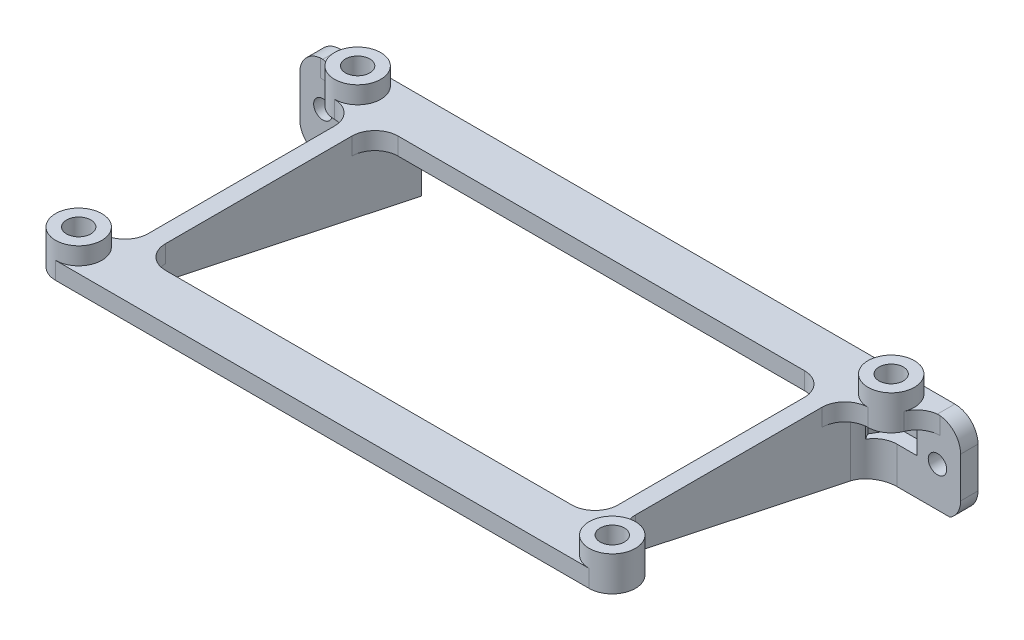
ISO-10303-21;
HEADER;
FILE_DESCRIPTION(('STEP AP214'),'2;1');
FILE_NAME('part.step','',(''),(''),'','','');
FILE_SCHEMA(('AUTOMOTIVE_DESIGN { 1 0 10303 214 1 1 1 1 }'));
ENDSEC;
DATA;
#1=APPLICATION_CONTEXT('core data for automotive mechanical design processes');
#2=APPLICATION_PROTOCOL_DEFINITION('international standard','automotive_design',2000,#1);
#3=PRODUCT_CONTEXT('',#1,'mechanical');
#4=PRODUCT('Part','Part','',(#3));
#5=PRODUCT_RELATED_PRODUCT_CATEGORY('part','',(#4));
#6=PRODUCT_DEFINITION_FORMATION('','',#4);
#7=PRODUCT_DEFINITION_CONTEXT('part definition',#1,'design');
#8=PRODUCT_DEFINITION('design','',#6,#7);
#9=PRODUCT_DEFINITION_SHAPE('','',#8);
#10=(LENGTH_UNIT() NAMED_UNIT(*) SI_UNIT(.MILLI.,.METRE.));
#11=(NAMED_UNIT(*) PLANE_ANGLE_UNIT() SI_UNIT($,.RADIAN.));
#12=(NAMED_UNIT(*) SI_UNIT($,.STERADIAN.) SOLID_ANGLE_UNIT());
#13=UNCERTAINTY_MEASURE_WITH_UNIT(LENGTH_MEASURE(1.E-05),#10,'distance_accuracy_value','');
#14=(GEOMETRIC_REPRESENTATION_CONTEXT(3) GLOBAL_UNCERTAINTY_ASSIGNED_CONTEXT((#13)) GLOBAL_UNIT_ASSIGNED_CONTEXT((#10,
#11,#12)) REPRESENTATION_CONTEXT('',''));
#15=CARTESIAN_POINT('',(0.,0.,0.));
#16=DIRECTION('',(0.,0.,1.));
#17=DIRECTION('',(1.,0.,0.));
#18=AXIS2_PLACEMENT_3D('',#15,#16,#17);
#19=CARTESIAN_POINT('',(92.2,-3.,0.));
#20=DIRECTION('',(0.,1.,0.));
#21=DIRECTION('',(0.,0.,1.));
#22=AXIS2_PLACEMENT_3D('',#19,#20,#21);
#23=CYLINDRICAL_SURFACE('',#22,2.1);
#24=CARTESIAN_POINT('',(92.2,3.,0.));
#25=DIRECTION('',(0.,1.,0.));
#26=DIRECTION('',(0.,0.,1.));
#27=AXIS2_PLACEMENT_3D('',#24,#25,#26);
#28=CIRCLE('',#27,2.1);
#29=CARTESIAN_POINT('',(92.2,3.,2.1));
#30=VERTEX_POINT('',#29);
#31=EDGE_CURVE('E512',#30,#30,#28,.T.);
#32=ORIENTED_EDGE('',*,*,#31,.T.);
#33=EDGE_LOOP('',(#32));
#34=FACE_BOUND('',#33,.T.);
#35=CARTESIAN_POINT('',(92.2,-3.,0.));
#36=DIRECTION('',(0.,1.,0.));
#37=DIRECTION('',(0.,0.,1.));
#38=AXIS2_PLACEMENT_3D('',#35,#36,#37);
#39=CIRCLE('',#38,2.1);
#40=CARTESIAN_POINT('',(92.2,-3.,2.1));
#41=VERTEX_POINT('',#40);
#42=EDGE_CURVE('E526',#41,#41,#39,.T.);
#43=ORIENTED_EDGE('',*,*,#42,.F.);
#44=EDGE_LOOP('',(#43));
#45=FACE_BOUND('',#44,.T.);
#46=ADVANCED_FACE('F33',(#34,#45),#23,.F.);
#47=CARTESIAN_POINT('',(0.,3.,0.));
#48=DIRECTION('',(0.,-1.,0.));
#49=DIRECTION('',(0.,0.,-1.));
#50=AXIS2_PLACEMENT_3D('',#47,#48,#49);
#51=CYLINDRICAL_SURFACE('',#50,2.1);
#52=CARTESIAN_POINT('',(0.,3.,0.));
#53=DIRECTION('',(0.,1.,0.));
#54=DIRECTION('',(0.,0.,1.));
#55=AXIS2_PLACEMENT_3D('',#52,#53,#54);
#56=CIRCLE('',#55,2.1);
#57=CARTESIAN_POINT('',(0.,3.,2.1));
#58=VERTEX_POINT('',#57);
#59=EDGE_CURVE('E584',#58,#58,#56,.T.);
#60=ORIENTED_EDGE('',*,*,#59,.T.);
#61=EDGE_LOOP('',(#60));
#62=FACE_BOUND('',#61,.T.);
#63=CARTESIAN_POINT('',(0.,-3.,0.));
#64=DIRECTION('',(0.,1.,0.));
#65=DIRECTION('',(0.,0.,1.));
#66=AXIS2_PLACEMENT_3D('',#63,#64,#65);
#67=CIRCLE('',#66,2.1);
#68=CARTESIAN_POINT('',(0.,-3.,2.1));
#69=VERTEX_POINT('',#68);
#70=EDGE_CURVE('E529',#69,#69,#67,.T.);
#71=ORIENTED_EDGE('',*,*,#70,.F.);
#72=EDGE_LOOP('',(#71));
#73=FACE_BOUND('',#72,.T.);
#74=ADVANCED_FACE('F820',(#62,#73),#51,.F.);
#75=CARTESIAN_POINT('',(92.2,0.,-1.00000000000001));
#76=DIRECTION('',(0.,0.,-1.));
#77=DIRECTION('',(1.,0.,0.));
#78=AXIS2_PLACEMENT_3D('',#75,#76,#77);
#79=PLANE('',#78);
#80=CARTESIAN_POINT('',(-7.00000000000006,-7.5,-0.999999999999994));
#81=DIRECTION('',(0.,0.,1.));
#82=DIRECTION('',(1.,0.,0.));
#83=AXIS2_PLACEMENT_3D('',#80,#81,#82);
#84=CIRCLE('',#83,1.60000000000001);
#85=CARTESIAN_POINT('',(-5.40000000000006,-7.5,-0.999999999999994));
#86=VERTEX_POINT('',#85);
#87=EDGE_CURVE('E417',#86,#86,#84,.T.);
#88=ORIENTED_EDGE('',*,*,#87,.F.);
#89=EDGE_LOOP('',(#88));
#90=FACE_BOUND('',#89,.T.);
#91=DIRECTION('',(0.,-1.,0.));
#92=VECTOR('',#91,1.);
#93=CARTESIAN_POINT('',(-3.46410161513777,0.,-0.999999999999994));
#94=LINE('',#93,#92);
#95=CARTESIAN_POINT('',(-3.46410161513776,-3.,-0.999999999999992));
#96=VERTEX_POINT('',#95);
#97=CARTESIAN_POINT('',(-3.46410161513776,-8.,-0.999999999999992));
#98=VERTEX_POINT('',#97);
#99=EDGE_CURVE('E1042',#96,#98,#94,.T.);
#100=ORIENTED_EDGE('',*,*,#99,.F.);
#101=DIRECTION('',(-1.,0.,0.));
#102=VECTOR('',#101,1.);
#103=CARTESIAN_POINT('',(0.,-3.,-0.999999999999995));
#104=LINE('',#103,#102);
#105=CARTESIAN_POINT('',(-7.41619848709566,-3.,-0.999999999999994));
#106=VERTEX_POINT('',#105);
#107=EDGE_CURVE('E426',#96,#106,#104,.T.);
#108=ORIENTED_EDGE('',*,*,#107,.T.);
#109=DIRECTION('',(0.,1.,0.));
#110=VECTOR('',#109,1.);
#111=CARTESIAN_POINT('',(-7.41619848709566,0.,-0.999999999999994));
#112=LINE('',#111,#110);
#113=CARTESIAN_POINT('',(-7.41619848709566,-0.0217115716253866,-0.999999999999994));
#114=VERTEX_POINT('',#113);
#115=EDGE_CURVE('E714',#106,#114,#112,.T.);
#116=ORIENTED_EDGE('',*,*,#115,.T.);
#117=CARTESIAN_POINT('',(-7.00000000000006,-4.,-0.999999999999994));
#118=DIRECTION('',(0.,0.,-1.));
#119=DIRECTION('',(-1.,0.,0.));
#120=AXIS2_PLACEMENT_3D('',#117,#118,#119);
#121=CIRCLE('',#120,4.);
#122=CARTESIAN_POINT('',(-11.0000000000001,-4.,-0.999999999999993));
#123=VERTEX_POINT('',#122);
#124=EDGE_CURVE('E649',#114,#123,#121,.F.);
#125=ORIENTED_EDGE('',*,*,#124,.T.);
#126=DIRECTION('',(0.,-1.,0.));
#127=VECTOR('',#126,1.);
#128=CARTESIAN_POINT('',(-11.0000000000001,-15.,-0.999999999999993));
#129=LINE('',#128,#127);
#130=CARTESIAN_POINT('',(-11.0000000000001,-11.,-0.999999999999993));
#131=VERTEX_POINT('',#130);
#132=EDGE_CURVE('E423',#123,#131,#129,.T.);
#133=ORIENTED_EDGE('',*,*,#132,.T.);
#134=CARTESIAN_POINT('',(-7.00000000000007,-11.,-0.999999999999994));
#135=DIRECTION('',(0.,0.,-1.));
#136=DIRECTION('',(-1.,0.,0.));
#137=AXIS2_PLACEMENT_3D('',#134,#135,#136);
#138=CIRCLE('',#137,4.);
#139=CARTESIAN_POINT('',(-9.17122684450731,-14.3594306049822,-0.999999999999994));
#140=VERTEX_POINT('',#139);
#141=EDGE_CURVE('E646',#131,#140,#138,.F.);
#142=ORIENTED_EDGE('',*,*,#141,.T.);
#143=DIRECTION('',(-1.,0.,0.));
#144=VECTOR('',#143,1.);
#145=CARTESIAN_POINT('',(103.2,-14.3594306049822,-1.00000000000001));
#146=LINE('',#145,#144);
#147=CARTESIAN_POINT('',(0.,-14.3594306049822,-1.));
#148=VERTEX_POINT('',#147);
#149=EDGE_CURVE('E411',#148,#140,#146,.T.);
#150=ORIENTED_EDGE('',*,*,#149,.F.);
#151=DIRECTION('',(0.,1.,0.));
#152=VECTOR('',#151,1.);
#153=CARTESIAN_POINT('',(0.,0.,-0.999999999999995));
#154=LINE('',#153,#152);
#155=CARTESIAN_POINT('',(0.,-8.,-0.999999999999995));
#156=VERTEX_POINT('',#155);
#157=EDGE_CURVE('E711',#148,#156,#154,.T.);
#158=ORIENTED_EDGE('',*,*,#157,.T.);
#159=DIRECTION('',(1.,0.,0.));
#160=VECTOR('',#159,1.);
#161=CARTESIAN_POINT('',(92.2,-8.,-1.00000000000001));
#162=LINE('',#161,#160);
#163=EDGE_CURVE('E56',#98,#156,#162,.T.);
#164=ORIENTED_EDGE('',*,*,#163,.F.);
#165=EDGE_LOOP('',(#100,#108,#116,#125,#133,#142,#150,#158,#164));
#166=FACE_BOUND('',#165,.T.);
#167=ADVANCED_FACE('F826',(#90,#166),#79,.F.);
#168=CARTESIAN_POINT('',(0.,0.,3.00000000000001));
#169=DIRECTION('',(0.,1.,0.));
#170=DIRECTION('',(0.,0.,1.));
#171=AXIS2_PLACEMENT_3D('',#168,#169,#170);
#172=CYLINDRICAL_SURFACE('',#171,4.);
#173=DIRECTION('',(0.,1.,0.));
#174=VECTOR('',#173,1.);
#175=CARTESIAN_POINT('',(3.46410161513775,0.,1.));
#176=LINE('',#175,#174);
#177=CARTESIAN_POINT('',(3.46410161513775,-8.,1.));
#178=VERTEX_POINT('',#177);
#179=CARTESIAN_POINT('',(3.46410161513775,-3.,1.));
#180=VERTEX_POINT('',#179);
#181=EDGE_CURVE('E1040',#178,#180,#176,.T.);
#182=ORIENTED_EDGE('',*,*,#181,.F.);
#183=CARTESIAN_POINT('',(0.,-8.,3.00000000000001));
#184=DIRECTION('',(0.,1.,0.));
#185=DIRECTION('',(0.,0.,1.));
#186=AXIS2_PLACEMENT_3D('',#183,#184,#185);
#187=CIRCLE('',#186,4.);
#188=EDGE_CURVE('E1034',#156,#178,#187,.F.);
#189=ORIENTED_EDGE('',*,*,#188,.F.);
#190=ORIENTED_EDGE('',*,*,#157,.F.);
#191=CARTESIAN_POINT('',(0.,-13.5053380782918,3.00000000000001));
#192=DIRECTION('',(0.,-0.977954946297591,0.208816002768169));
#193=DIRECTION('',(0.,0.208816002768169,0.977954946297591));
#194=AXIS2_PLACEMENT_3D('',#191,#192,#193);
#195=ELLIPSE('',#194,4.09016797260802,4.);
#196=CARTESIAN_POINT('',(4.,-13.5053380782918,2.99999999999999));
#197=VERTEX_POINT('',#196);
#198=EDGE_CURVE('E1033',#197,#148,#195,.F.);
#199=ORIENTED_EDGE('',*,*,#198,.F.);
#200=DIRECTION('',(0.,1.,0.));
#201=VECTOR('',#200,1.);
#202=CARTESIAN_POINT('',(4.,-3.,3.));
#203=LINE('',#202,#201);
#204=CARTESIAN_POINT('',(4.,-3.,3.));
#205=VERTEX_POINT('',#204);
#206=EDGE_CURVE('E692',#205,#197,#203,.F.);
#207=ORIENTED_EDGE('',*,*,#206,.F.);
#208=CARTESIAN_POINT('',(0.,-3.,3.00000000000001));
#209=DIRECTION('',(0.,1.,0.));
#210=DIRECTION('',(0.,0.,1.));
#211=AXIS2_PLACEMENT_3D('',#208,#209,#210);
#212=CIRCLE('',#211,4.);
#213=EDGE_CURVE('E719',#180,#205,#212,.F.);
#214=ORIENTED_EDGE('',*,*,#213,.F.);
#215=EDGE_LOOP('',(#182,#189,#190,#199,#207,#214));
#216=FACE_BOUND('',#215,.T.);
#217=ADVANCED_FACE('F35',(#216),#172,.F.);
#218=CARTESIAN_POINT('',(0.,-3.,0.));
#219=DIRECTION('',(0.,1.,0.));
#220=DIRECTION('',(0.,0.,1.));
#221=AXIS2_PLACEMENT_3D('',#218,#219,#220);
#222=PLANE('',#221);
#223=CARTESIAN_POINT('',(0.,-3.,8.));
#224=DIRECTION('',(0.,1.,0.));
#225=DIRECTION('',(0.,0.,1.));
#226=AXIS2_PLACEMENT_3D('',#223,#224,#225);
#227=CIRCLE('',#226,4.);
#228=CARTESIAN_POINT('',(4.,-3.,8.));
#229=VERTEX_POINT('',#228);
#230=CARTESIAN_POINT('',(0.,-3.,4.));
#231=VERTEX_POINT('',#230);
#232=EDGE_CURVE('E755',#229,#231,#227,.T.);
#233=ORIENTED_EDGE('',*,*,#232,.T.);
#234=CARTESIAN_POINT('',(0.,-3.,0.));
#235=DIRECTION('',(0.,1.,0.));
#236=DIRECTION('',(0.,0.,1.));
#237=AXIS2_PLACEMENT_3D('',#234,#235,#236);
#238=CIRCLE('',#237,4.);
#239=CARTESIAN_POINT('',(-3.70809924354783,-3.,1.5));
#240=VERTEX_POINT('',#239);
#241=EDGE_CURVE('E548',#240,#231,#238,.T.);
#242=ORIENTED_EDGE('',*,*,#241,.F.);
#243=CARTESIAN_POINT('',(-7.41619848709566,-3.,3.00000000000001));
#244=DIRECTION('',(0.,1.,0.));
#245=DIRECTION('',(0.,0.,1.));
#246=AXIS2_PLACEMENT_3D('',#243,#244,#245);
#247=CIRCLE('',#246,4.);
#248=EDGE_CURVE('E1031',#240,#106,#247,.T.);
#249=ORIENTED_EDGE('',*,*,#248,.T.);
#250=ORIENTED_EDGE('',*,*,#107,.F.);
#251=DIRECTION('',(0.5,0.,-0.866025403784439));
#252=VECTOR('',#251,1.);
#253=CARTESIAN_POINT('',(-4.04145188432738,-3.,0.));
#254=LINE('',#253,#252);
#255=CARTESIAN_POINT('',(-2.02072594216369,-3.,-3.5));
#256=VERTEX_POINT('',#255);
#257=EDGE_CURVE('E354',#96,#256,#254,.T.);
#258=ORIENTED_EDGE('',*,*,#257,.T.);
#259=DIRECTION('',(1.,0.,0.));
#260=VECTOR('',#259,1.);
#261=CARTESIAN_POINT('',(-2.02072594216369,-3.,-3.5));
#262=LINE('',#261,#260);
#263=CARTESIAN_POINT('',(2.02072594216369,-3.,-3.5));
#264=VERTEX_POINT('',#263);
#265=EDGE_CURVE('E395',#256,#264,#262,.T.);
#266=ORIENTED_EDGE('',*,*,#265,.T.);
#267=DIRECTION('',(0.5,0.,0.866025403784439));
#268=VECTOR('',#267,1.);
#269=CARTESIAN_POINT('',(2.02072594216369,-3.,-3.5));
#270=LINE('',#269,#268);
#271=CARTESIAN_POINT('',(4.04145188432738,-3.,0.));
#272=VERTEX_POINT('',#271);
#273=EDGE_CURVE('E397',#264,#272,#270,.T.);
#274=ORIENTED_EDGE('',*,*,#273,.T.);
#275=DIRECTION('',(-0.5,0.,0.866025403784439));
#276=VECTOR('',#275,1.);
#277=CARTESIAN_POINT('',(4.04145188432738,-3.,0.));
#278=LINE('',#277,#276);
#279=EDGE_CURVE('E48',#272,#180,#278,.T.);
#280=ORIENTED_EDGE('',*,*,#279,.T.);
#281=ORIENTED_EDGE('',*,*,#213,.T.);
#282=DIRECTION('',(0.,0.,-1.));
#283=VECTOR('',#282,1.);
#284=CARTESIAN_POINT('',(4.,-3.,-4.));
#285=LINE('',#284,#283);
#286=EDGE_CURVE('E620',#229,#205,#285,.T.);
#287=ORIENTED_EDGE('',*,*,#286,.F.);
#288=EDGE_LOOP('',(#233,#242,#249,#250,#258,#266,#274,#280,#281,#287));
#289=FACE_BOUND('',#288,.T.);
#290=ORIENTED_EDGE('',*,*,#70,.T.);
#291=EDGE_LOOP('',(#290));
#292=FACE_BOUND('',#291,.T.);
#293=ADVANCED_FACE('F859',(#289,#292),#222,.F.);
#294=CARTESIAN_POINT('',(0.,3.,0.));
#295=DIRECTION('',(0.,-1.,0.));
#296=DIRECTION('',(0.,0.,-1.));
#297=AXIS2_PLACEMENT_3D('',#294,#295,#296);
#298=CYLINDRICAL_SURFACE('',#297,4.);
#299=CARTESIAN_POINT('',(0.,3.,0.));
#300=DIRECTION('',(0.,1.,0.));
#301=DIRECTION('',(0.,0.,1.));
#302=AXIS2_PLACEMENT_3D('',#299,#300,#301);
#303=CIRCLE('',#302,4.);
#304=CARTESIAN_POINT('',(0.,3.,4.));
#305=VERTEX_POINT('',#304);
#306=EDGE_CURVE('E583',#305,#305,#303,.T.);
#307=ORIENTED_EDGE('',*,*,#306,.F.);
#308=EDGE_LOOP('',(#307));
#309=FACE_BOUND('',#308,.T.);
#310=CARTESIAN_POINT('',(0.,0.,0.));
#311=DIRECTION('',(0.,-1.,0.));
#312=DIRECTION('',(1.,0.,0.));
#313=AXIS2_PLACEMENT_3D('',#310,#311,#312);
#314=CIRCLE('',#313,4.);
#315=CARTESIAN_POINT('',(-3.70809924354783,0.,1.5));
#316=VERTEX_POINT('',#315);
#317=CARTESIAN_POINT('',(0.,0.,-4.));
#318=VERTEX_POINT('',#317);
#319=EDGE_CURVE('E435',#316,#318,#314,.T.);
#320=ORIENTED_EDGE('',*,*,#319,.F.);
#321=DIRECTION('',(0.,-1.,0.));
#322=VECTOR('',#321,1.);
#323=CARTESIAN_POINT('',(-3.70809924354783,3.,1.5));
#324=LINE('',#323,#322);
#325=EDGE_CURVE('E717',#316,#240,#324,.T.);
#326=ORIENTED_EDGE('',*,*,#325,.T.);
#327=ORIENTED_EDGE('',*,*,#241,.T.);
#328=DIRECTION('',(0.,1.,0.));
#329=VECTOR('',#328,1.);
#330=CARTESIAN_POINT('',(0.,-3.,4.));
#331=LINE('',#330,#329);
#332=CARTESIAN_POINT('',(0.,0.,4.));
#333=VERTEX_POINT('',#332);
#334=EDGE_CURVE('E574',#231,#333,#331,.T.);
#335=ORIENTED_EDGE('',*,*,#334,.T.);
#336=CARTESIAN_POINT('',(0.,0.,0.));
#337=DIRECTION('',(0.,1.,0.));
#338=DIRECTION('',(0.,0.,1.));
#339=AXIS2_PLACEMENT_3D('',#336,#337,#338);
#340=CIRCLE('',#339,4.);
#341=EDGE_CURVE('E581',#333,#318,#340,.T.);
#342=ORIENTED_EDGE('',*,*,#341,.T.);
#343=EDGE_LOOP('',(#320,#326,#327,#335,#342));
#344=FACE_BOUND('',#343,.T.);
#345=ADVANCED_FACE('F784',(#309,#344),#298,.T.);
#346=CARTESIAN_POINT('',(4.,-3.,4.));
#347=DIRECTION('',(-1.,0.,0.));
#348=DIRECTION('',(0.,0.,1.));
#349=AXIS2_PLACEMENT_3D('',#346,#347,#348);
#350=PLANE('',#349);
#351=CARTESIAN_POINT('',(4.00000000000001,-3.,52.2));
#352=VERTEX_POINT('',#351);
#353=CARTESIAN_POINT('',(4.00000000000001,-3.,40.2));
#354=VERTEX_POINT('',#353);
#355=EDGE_CURVE('E494',#352,#354,#285,.T.);
#356=ORIENTED_EDGE('',*,*,#355,.T.);
#357=DIRECTION('',(0.,1.,0.));
#358=VECTOR('',#357,1.);
#359=CARTESIAN_POINT('',(4.00000000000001,0.,40.2));
#360=LINE('',#359,#358);
#361=CARTESIAN_POINT('',(4.00000000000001,0.,40.2));
#362=VERTEX_POINT('',#361);
#363=EDGE_CURVE('E697',#354,#362,#360,.T.);
#364=ORIENTED_EDGE('',*,*,#363,.T.);
#365=DIRECTION('',(0.,0.,1.));
#366=VECTOR('',#365,1.);
#367=CARTESIAN_POINT('',(4.,0.,4.));
#368=LINE('',#367,#366);
#369=CARTESIAN_POINT('',(4.,0.,8.));
#370=VERTEX_POINT('',#369);
#371=EDGE_CURVE('E607',#370,#362,#368,.T.);
#372=ORIENTED_EDGE('',*,*,#371,.F.);
#373=DIRECTION('',(0.,1.,0.));
#374=VECTOR('',#373,1.);
#375=CARTESIAN_POINT('',(4.,-3.,8.));
#376=LINE('',#375,#374);
#377=EDGE_CURVE('E694',#370,#229,#376,.F.);
#378=ORIENTED_EDGE('',*,*,#377,.T.);
#379=ORIENTED_EDGE('',*,*,#286,.T.);
#380=ORIENTED_EDGE('',*,*,#206,.T.);
#381=DIRECTION('',(0.,0.208816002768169,0.977954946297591));
#382=VECTOR('',#381,1.);
#383=CARTESIAN_POINT('',(4.00000000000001,-3.,52.2));
#384=LINE('',#383,#382);
#385=EDGE_CURVE('E476',#197,#352,#384,.T.);
#386=ORIENTED_EDGE('',*,*,#385,.T.);
#387=EDGE_LOOP('',(#356,#364,#372,#378,#379,#380,#386));
#388=FACE_BOUND('',#387,.T.);
#389=ADVANCED_FACE('F891',(#388),#350,.T.);
#390=CARTESIAN_POINT('',(99.6161984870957,-3.,3.));
#391=DIRECTION('',(0.,1.,0.));
#392=DIRECTION('',(0.,0.,1.));
#393=AXIS2_PLACEMENT_3D('',#390,#391,#392);
#394=CIRCLE('',#393,4.);
#395=CARTESIAN_POINT('',(99.6161984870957,-3.,-1.));
#396=VERTEX_POINT('',#395);
#397=CARTESIAN_POINT('',(95.9080992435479,-3.,1.50000000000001));
#398=VERTEX_POINT('',#397);
#399=EDGE_CURVE('E770',#396,#398,#394,.T.);
#400=ORIENTED_EDGE('',*,*,#399,.T.);
#401=CARTESIAN_POINT('',(92.2,-3.,0.));
#402=DIRECTION('',(0.,1.,0.));
#403=DIRECTION('',(0.,0.,1.));
#404=AXIS2_PLACEMENT_3D('',#401,#402,#403);
#405=CIRCLE('',#404,4.00000000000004);
#406=CARTESIAN_POINT('',(92.2,-3.,4.));
#407=VERTEX_POINT('',#406);
#408=EDGE_CURVE('E612',#407,#398,#405,.T.);
#409=ORIENTED_EDGE('',*,*,#408,.F.);
#410=CARTESIAN_POINT('',(92.2,-3.,8.));
#411=DIRECTION('',(0.,1.,0.));
#412=DIRECTION('',(0.,0.,1.));
#413=AXIS2_PLACEMENT_3D('',#410,#411,#412);
#414=CIRCLE('',#413,4.);
#415=CARTESIAN_POINT('',(88.2,-3.,8.));
#416=VERTEX_POINT('',#415);
#417=EDGE_CURVE('E723',#407,#416,#414,.T.);
#418=ORIENTED_EDGE('',*,*,#417,.T.);
#419=DIRECTION('',(0.,0.,-1.));
#420=VECTOR('',#419,1.);
#421=CARTESIAN_POINT('',(88.2,-3.,-4.00000000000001));
#422=LINE('',#421,#420);
#423=CARTESIAN_POINT('',(88.2,-3.,3.));
#424=VERTEX_POINT('',#423);
#425=EDGE_CURVE('E460',#416,#424,#422,.T.);
#426=ORIENTED_EDGE('',*,*,#425,.T.);
#427=CARTESIAN_POINT('',(92.2,-3.,3.));
#428=DIRECTION('',(0.,1.,0.));
#429=DIRECTION('',(0.,0.,1.));
#430=AXIS2_PLACEMENT_3D('',#427,#428,#429);
#431=CIRCLE('',#430,4.);
#432=CARTESIAN_POINT('',(88.7358983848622,-3.,0.999999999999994));
#433=VERTEX_POINT('',#432);
#434=EDGE_CURVE('E708',#424,#433,#431,.F.);
#435=ORIENTED_EDGE('',*,*,#434,.T.);
#436=DIRECTION('',(0.5,0.,0.866025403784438));
#437=VECTOR('',#436,1.);
#438=CARTESIAN_POINT('',(88.1585481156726,-3.,0.));
#439=LINE('',#438,#437);
#440=CARTESIAN_POINT('',(88.1585481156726,-3.,0.));
#441=VERTEX_POINT('',#440);
#442=EDGE_CURVE('E374',#441,#433,#439,.T.);
#443=ORIENTED_EDGE('',*,*,#442,.F.);
#444=DIRECTION('',(-0.5,0.,0.866025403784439));
#445=VECTOR('',#444,1.);
#446=CARTESIAN_POINT('',(90.1792740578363,-3.,-3.50000000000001));
#447=LINE('',#446,#445);
#448=CARTESIAN_POINT('',(90.1792740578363,-3.,-3.50000000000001));
#449=VERTEX_POINT('',#448);
#450=EDGE_CURVE('E351',#449,#441,#447,.T.);
#451=ORIENTED_EDGE('',*,*,#450,.F.);
#452=DIRECTION('',(-1.,0.,0.));
#453=VECTOR('',#452,1.);
#454=CARTESIAN_POINT('',(94.2207259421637,-3.,-3.50000000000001));
#455=LINE('',#454,#453);
#456=CARTESIAN_POINT('',(94.2207259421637,-3.,-3.50000000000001));
#457=VERTEX_POINT('',#456);
#458=EDGE_CURVE('E377',#457,#449,#455,.T.);
#459=ORIENTED_EDGE('',*,*,#458,.F.);
#460=DIRECTION('',(-0.5,0.,-0.866025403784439));
#461=VECTOR('',#460,1.);
#462=CARTESIAN_POINT('',(96.2414518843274,-3.,0.));
#463=LINE('',#462,#461);
#464=CARTESIAN_POINT('',(95.6641016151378,-3.,-1.));
#465=VERTEX_POINT('',#464);
#466=EDGE_CURVE('E363',#465,#457,#463,.T.);
#467=ORIENTED_EDGE('',*,*,#466,.F.);
#468=DIRECTION('',(-1.,0.,0.));
#469=VECTOR('',#468,1.);
#470=CARTESIAN_POINT('',(0.,-3.,-1.));
#471=LINE('',#470,#469);
#472=EDGE_CURVE('E450',#396,#465,#471,.T.);
#473=ORIENTED_EDGE('',*,*,#472,.F.);
#474=EDGE_LOOP('',(#400,#409,#418,#426,#435,#443,#451,#459,#467,#473));
#475=FACE_BOUND('',#474,.T.);
#476=ORIENTED_EDGE('',*,*,#42,.T.);
#477=EDGE_LOOP('',(#476));
#478=FACE_BOUND('',#477,.T.);
#479=ADVANCED_FACE('F879',(#475,#478),#222,.F.);
#480=CARTESIAN_POINT('',(88.2,-3.,4.));
#481=DIRECTION('',(1.,0.,0.));
#482=DIRECTION('',(0.,0.,-1.));
#483=AXIS2_PLACEMENT_3D('',#480,#481,#482);
#484=PLANE('',#483);
#485=ORIENTED_EDGE('',*,*,#425,.F.);
#486=DIRECTION('',(0.,1.,0.));
#487=VECTOR('',#486,1.);
#488=CARTESIAN_POINT('',(88.2,0.,8.));
#489=LINE('',#488,#487);
#490=CARTESIAN_POINT('',(88.2,0.,8.));
#491=VERTEX_POINT('',#490);
#492=EDGE_CURVE('E660',#416,#491,#489,.T.);
#493=ORIENTED_EDGE('',*,*,#492,.T.);
#494=DIRECTION('',(0.,0.,-1.));
#495=VECTOR('',#494,1.);
#496=CARTESIAN_POINT('',(88.2,0.,4.));
#497=LINE('',#496,#495);
#498=CARTESIAN_POINT('',(88.2,0.,40.2));
#499=VERTEX_POINT('',#498);
#500=EDGE_CURVE('E571',#499,#491,#497,.T.);
#501=ORIENTED_EDGE('',*,*,#500,.F.);
#502=DIRECTION('',(0.,1.,0.));
#503=VECTOR('',#502,1.);
#504=CARTESIAN_POINT('',(88.2,-3.,40.2));
#505=LINE('',#504,#503);
#506=CARTESIAN_POINT('',(88.2,-3.,40.2));
#507=VERTEX_POINT('',#506);
#508=EDGE_CURVE('E657',#499,#507,#505,.F.);
#509=ORIENTED_EDGE('',*,*,#508,.T.);
#510=CARTESIAN_POINT('',(88.2,-3.,52.2));
#511=VERTEX_POINT('',#510);
#512=EDGE_CURVE('E471',#511,#507,#422,.T.);
#513=ORIENTED_EDGE('',*,*,#512,.F.);
#514=DIRECTION('',(0.,0.208816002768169,0.977954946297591));
#515=VECTOR('',#514,1.);
#516=CARTESIAN_POINT('',(88.2,-3.,52.2));
#517=LINE('',#516,#515);
#518=CARTESIAN_POINT('',(88.2,-13.5053380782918,2.99999999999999));
#519=VERTEX_POINT('',#518);
#520=EDGE_CURVE('E465',#519,#511,#517,.T.);
#521=ORIENTED_EDGE('',*,*,#520,.F.);
#522=DIRECTION('',(0.,1.,0.));
#523=VECTOR('',#522,1.);
#524=CARTESIAN_POINT('',(88.2,-3.,3.));
#525=LINE('',#524,#523);
#526=EDGE_CURVE('E654',#519,#424,#525,.T.);
#527=ORIENTED_EDGE('',*,*,#526,.T.);
#528=EDGE_LOOP('',(#485,#493,#501,#509,#513,#521,#527));
#529=FACE_BOUND('',#528,.T.);
#530=ADVANCED_FACE('F875',(#529),#484,.T.);
#531=DIRECTION('',(-1.,0.,0.));
#532=VECTOR('',#531,1.);
#533=CARTESIAN_POINT('',(0.,-3.,-4.));
#534=LINE('',#533,#532);
#535=CARTESIAN_POINT('',(85.2,-3.,-4.00000000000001));
#536=VERTEX_POINT('',#535);
#537=CARTESIAN_POINT('',(7.,-3.,-4.));
#538=VERTEX_POINT('',#537);
#539=EDGE_CURVE('E578',#536,#538,#534,.T.);
#540=ORIENTED_EDGE('',*,*,#539,.F.);
#541=DIRECTION('',(0.,0.,-1.));
#542=VECTOR('',#541,1.);
#543=CARTESIAN_POINT('',(85.2,-3.,-4.00000000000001));
#544=LINE('',#543,#542);
#545=CARTESIAN_POINT('',(85.2,-3.,8.));
#546=VERTEX_POINT('',#545);
#547=EDGE_CURVE('E464',#546,#536,#544,.T.);
#548=ORIENTED_EDGE('',*,*,#547,.F.);
#549=CARTESIAN_POINT('',(81.1999992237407,-3.,8.));
#550=DIRECTION('',(0.,1.,0.));
#551=DIRECTION('',(0.,0.,1.));
#552=AXIS2_PLACEMENT_3D('',#549,#550,#551);
#553=CIRCLE('',#552,4.);
#554=CARTESIAN_POINT('',(81.1999992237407,-3.,4.));
#555=VERTEX_POINT('',#554);
#556=EDGE_CURVE('E737',#546,#555,#553,.T.);
#557=ORIENTED_EDGE('',*,*,#556,.T.);
#558=DIRECTION('',(-1.,0.,0.));
#559=VECTOR('',#558,1.);
#560=CARTESIAN_POINT('',(7.,-3.,4.));
#561=LINE('',#560,#559);
#562=CARTESIAN_POINT('',(11.,-3.,4.));
#563=VERTEX_POINT('',#562);
#564=EDGE_CURVE('E610',#555,#563,#561,.T.);
#565=ORIENTED_EDGE('',*,*,#564,.T.);
#566=CARTESIAN_POINT('',(11.,-3.,8.));
#567=DIRECTION('',(0.,1.,0.));
#568=DIRECTION('',(0.,0.,1.));
#569=AXIS2_PLACEMENT_3D('',#566,#567,#568);
#570=CIRCLE('',#569,4.);
#571=CARTESIAN_POINT('',(7.,-3.,8.));
#572=VERTEX_POINT('',#571);
#573=EDGE_CURVE('E745',#563,#572,#570,.T.);
#574=ORIENTED_EDGE('',*,*,#573,.T.);
#575=DIRECTION('',(0.,0.,-1.));
#576=VECTOR('',#575,1.);
#577=CARTESIAN_POINT('',(7.,-3.,-4.));
#578=LINE('',#577,#576);
#579=EDGE_CURVE('E485',#572,#538,#578,.T.);
#580=ORIENTED_EDGE('',*,*,#579,.T.);
#581=EDGE_LOOP('',(#540,#548,#557,#565,#574,#580));
#582=FACE_BOUND('',#581,.T.);
#583=ADVANCED_FACE('F878',(#582),#222,.F.);
#584=CARTESIAN_POINT('',(92.2,-3.,48.2));
#585=DIRECTION('',(0.,1.,0.));
#586=DIRECTION('',(0.,0.,1.));
#587=AXIS2_PLACEMENT_3D('',#584,#585,#586);
#588=CIRCLE('',#587,2.1);
#589=CARTESIAN_POINT('',(92.2,-3.,50.3));
#590=VERTEX_POINT('',#589);
#591=EDGE_CURVE('E521',#590,#590,#588,.T.);
#592=ORIENTED_EDGE('',*,*,#591,.T.);
#593=EDGE_LOOP('',(#592));
#594=FACE_BOUND('',#593,.T.);
#595=ORIENTED_EDGE('',*,*,#512,.T.);
#596=CARTESIAN_POINT('',(92.2,-3.,40.2));
#597=DIRECTION('',(0.,1.,0.));
#598=DIRECTION('',(0.,0.,1.));
#599=AXIS2_PLACEMENT_3D('',#596,#597,#598);
#600=CIRCLE('',#599,4.);
#601=CARTESIAN_POINT('',(92.2,-3.,44.2));
#602=VERTEX_POINT('',#601);
#603=EDGE_CURVE('E728',#507,#602,#600,.T.);
#604=ORIENTED_EDGE('',*,*,#603,.T.);
#605=CARTESIAN_POINT('',(92.2,-3.,48.2));
#606=DIRECTION('',(0.,1.,0.));
#607=DIRECTION('',(0.,0.,1.));
#608=AXIS2_PLACEMENT_3D('',#605,#606,#607);
#609=CIRCLE('',#608,4.00000000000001);
#610=CARTESIAN_POINT('',(92.2,-3.,52.2));
#611=VERTEX_POINT('',#610);
#612=EDGE_CURVE('E557',#611,#602,#609,.T.);
#613=ORIENTED_EDGE('',*,*,#612,.F.);
#614=DIRECTION('',(1.,0.,0.));
#615=VECTOR('',#614,1.);
#616=CARTESIAN_POINT('',(-7.7625933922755E-07,-3.,52.2));
#617=LINE('',#616,#615);
#618=EDGE_CURVE('E554',#511,#611,#617,.T.);
#619=ORIENTED_EDGE('',*,*,#618,.F.);
#620=EDGE_LOOP('',(#595,#604,#613,#619));
#621=FACE_BOUND('',#620,.T.);
#622=ADVANCED_FACE('F918',(#594,#621),#222,.F.);
#623=CARTESIAN_POINT('',(0.,-3.,48.2));
#624=DIRECTION('',(0.,1.,0.));
#625=DIRECTION('',(0.,0.,1.));
#626=AXIS2_PLACEMENT_3D('',#623,#624,#625);
#627=CIRCLE('',#626,2.1);
#628=CARTESIAN_POINT('',(0.,-3.,50.3));
#629=VERTEX_POINT('',#628);
#630=EDGE_CURVE('E532',#629,#629,#627,.T.);
#631=ORIENTED_EDGE('',*,*,#630,.T.);
#632=EDGE_LOOP('',(#631));
#633=FACE_BOUND('',#632,.T.);
#634=ORIENTED_EDGE('',*,*,#355,.F.);
#635=CARTESIAN_POINT('',(-7.76259339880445E-07,-3.,52.2));
#636=VERTEX_POINT('',#635);
#637=EDGE_CURVE('E564',#636,#352,#617,.T.);
#638=ORIENTED_EDGE('',*,*,#637,.F.);
#639=CARTESIAN_POINT('',(0.,-3.,48.2));
#640=DIRECTION('',(0.,1.,0.));
#641=DIRECTION('',(0.,0.,1.));
#642=AXIS2_PLACEMENT_3D('',#639,#640,#641);
#643=CIRCLE('',#642,4.00000000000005);
#644=CARTESIAN_POINT('',(0.,-3.,44.2));
#645=VERTEX_POINT('',#644);
#646=EDGE_CURVE('E550',#645,#636,#643,.T.);
#647=ORIENTED_EDGE('',*,*,#646,.F.);
#648=CARTESIAN_POINT('',(0.,-3.,40.2));
#649=DIRECTION('',(0.,1.,0.));
#650=DIRECTION('',(0.,0.,1.));
#651=AXIS2_PLACEMENT_3D('',#648,#649,#650);
#652=CIRCLE('',#651,4.);
#653=EDGE_CURVE('E750',#645,#354,#652,.T.);
#654=ORIENTED_EDGE('',*,*,#653,.T.);
#655=EDGE_LOOP('',(#634,#638,#647,#654));
#656=FACE_BOUND('',#655,.T.);
#657=ADVANCED_FACE('F860',(#633,#656),#222,.F.);
#658=CARTESIAN_POINT('',(0.,0.,0.));
#659=DIRECTION('',(0.,1.,0.));
#660=DIRECTION('',(0.,0.,1.));
#661=AXIS2_PLACEMENT_3D('',#658,#659,#660);
#662=PLANE('',#661);
#663=DIRECTION('',(-1.,0.,0.));
#664=VECTOR('',#663,1.);
#665=CARTESIAN_POINT('',(0.,0.,-4.));
#666=LINE('',#665,#664);
#667=CARTESIAN_POINT('',(92.2,0.,-4.));
#668=VERTEX_POINT('',#667);
#669=EDGE_CURVE('E551',#668,#318,#666,.T.);
#670=ORIENTED_EDGE('',*,*,#669,.T.);
#671=ORIENTED_EDGE('',*,*,#341,.F.);
#672=CARTESIAN_POINT('',(0.,0.,8.));
#673=DIRECTION('',(0.,1.,0.));
#674=DIRECTION('',(0.,0.,1.));
#675=AXIS2_PLACEMENT_3D('',#672,#673,#674);
#676=CIRCLE('',#675,4.);
#677=EDGE_CURVE('E753',#333,#370,#676,.F.);
#678=ORIENTED_EDGE('',*,*,#677,.T.);
#679=ORIENTED_EDGE('',*,*,#371,.T.);
#680=CARTESIAN_POINT('',(0.,0.,40.2));
#681=DIRECTION('',(0.,1.,0.));
#682=DIRECTION('',(0.,0.,1.));
#683=AXIS2_PLACEMENT_3D('',#680,#681,#682);
#684=CIRCLE('',#683,4.);
#685=CARTESIAN_POINT('',(0.,0.,44.2));
#686=VERTEX_POINT('',#685);
#687=EDGE_CURVE('E748',#362,#686,#684,.F.);
#688=ORIENTED_EDGE('',*,*,#687,.T.);
#689=CARTESIAN_POINT('',(0.,0.,48.2));
#690=DIRECTION('',(0.,1.,0.));
#691=DIRECTION('',(0.,0.,1.));
#692=AXIS2_PLACEMENT_3D('',#689,#690,#691);
#693=CIRCLE('',#692,4.);
#694=CARTESIAN_POINT('',(0.,0.,52.2));
#695=VERTEX_POINT('',#694);
#696=EDGE_CURVE('E498',#695,#686,#693,.T.);
#697=ORIENTED_EDGE('',*,*,#696,.F.);
#698=DIRECTION('',(1.,0.,0.));
#699=VECTOR('',#698,1.);
#700=CARTESIAN_POINT('',(-7.7625933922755E-07,0.,52.2));
#701=LINE('',#700,#699);
#702=CARTESIAN_POINT('',(92.2,0.,52.2));
#703=VERTEX_POINT('',#702);
#704=EDGE_CURVE('E604',#695,#703,#701,.T.);
#705=ORIENTED_EDGE('',*,*,#704,.T.);
#706=CARTESIAN_POINT('',(92.2,0.,48.2));
#707=DIRECTION('',(0.,1.,0.));
#708=DIRECTION('',(0.,0.,1.));
#709=AXIS2_PLACEMENT_3D('',#706,#707,#708);
#710=CIRCLE('',#709,4.00000000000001);
#711=CARTESIAN_POINT('',(92.2,0.,44.2));
#712=VERTEX_POINT('',#711);
#713=EDGE_CURVE('E508',#712,#703,#710,.T.);
#714=ORIENTED_EDGE('',*,*,#713,.F.);
#715=CARTESIAN_POINT('',(92.2,0.,40.2));
#716=DIRECTION('',(0.,1.,0.));
#717=DIRECTION('',(0.,0.,1.));
#718=AXIS2_PLACEMENT_3D('',#715,#716,#717);
#719=CIRCLE('',#718,4.);
#720=EDGE_CURVE('E726',#712,#499,#719,.F.);
#721=ORIENTED_EDGE('',*,*,#720,.T.);
#722=ORIENTED_EDGE('',*,*,#500,.T.);
#723=CARTESIAN_POINT('',(92.2,0.,8.));
#724=DIRECTION('',(0.,1.,0.));
#725=DIRECTION('',(0.,0.,1.));
#726=AXIS2_PLACEMENT_3D('',#723,#724,#725);
#727=CIRCLE('',#726,4.);
#728=CARTESIAN_POINT('',(92.2,0.,4.));
#729=VERTEX_POINT('',#728);
#730=EDGE_CURVE('E721',#491,#729,#727,.F.);
#731=ORIENTED_EDGE('',*,*,#730,.T.);
#732=CARTESIAN_POINT('',(92.2,0.,0.));
#733=DIRECTION('',(0.,1.,0.));
#734=DIRECTION('',(0.,0.,1.));
#735=AXIS2_PLACEMENT_3D('',#732,#733,#734);
#736=CIRCLE('',#735,4.00000000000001);
#737=EDGE_CURVE('E517',#668,#729,#736,.T.);
#738=ORIENTED_EDGE('',*,*,#737,.F.);
#739=EDGE_LOOP('',(#670,#671,#678,#679,#688,#697,#705,#714,#721,#722,#731,#738));
#740=FACE_BOUND('',#739,.T.);
#741=DIRECTION('',(0.,0.,1.));
#742=VECTOR('',#741,1.);
#743=CARTESIAN_POINT('',(7.,0.,4.));
#744=LINE('',#743,#742);
#745=CARTESIAN_POINT('',(7.,0.,8.));
#746=VERTEX_POINT('',#745);
#747=CARTESIAN_POINT('',(7.00000000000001,0.,40.2));
#748=VERTEX_POINT('',#747);
#749=EDGE_CURVE('E535',#746,#748,#744,.T.);
#750=ORIENTED_EDGE('',*,*,#749,.F.);
#751=CARTESIAN_POINT('',(11.,0.,8.));
#752=DIRECTION('',(0.,1.,0.));
#753=DIRECTION('',(0.,0.,1.));
#754=AXIS2_PLACEMENT_3D('',#751,#752,#753);
#755=CIRCLE('',#754,4.);
#756=CARTESIAN_POINT('',(11.,0.,4.));
#757=VERTEX_POINT('',#756);
#758=EDGE_CURVE('E743',#746,#757,#755,.F.);
#759=ORIENTED_EDGE('',*,*,#758,.T.);
#760=DIRECTION('',(-1.,0.,0.));
#761=VECTOR('',#760,1.);
#762=CARTESIAN_POINT('',(7.,0.,4.));
#763=LINE('',#762,#761);
#764=CARTESIAN_POINT('',(81.1999992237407,0.,4.));
#765=VERTEX_POINT('',#764);
#766=EDGE_CURVE('E544',#765,#757,#763,.T.);
#767=ORIENTED_EDGE('',*,*,#766,.F.);
#768=CARTESIAN_POINT('',(81.1999992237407,0.,8.));
#769=DIRECTION('',(0.,1.,0.));
#770=DIRECTION('',(0.,0.,1.));
#771=AXIS2_PLACEMENT_3D('',#768,#769,#770);
#772=CIRCLE('',#771,4.);
#773=CARTESIAN_POINT('',(85.1999992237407,0.,8.));
#774=VERTEX_POINT('',#773);
#775=EDGE_CURVE('E735',#765,#774,#772,.F.);
#776=ORIENTED_EDGE('',*,*,#775,.T.);
#777=DIRECTION('',(0.,0.,-1.));
#778=VECTOR('',#777,1.);
#779=CARTESIAN_POINT('',(85.1999992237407,0.,4.));
#780=LINE('',#779,#778);
#781=CARTESIAN_POINT('',(85.1999992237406,0.,40.2));
#782=VERTEX_POINT('',#781);
#783=EDGE_CURVE('E541',#782,#774,#780,.T.);
#784=ORIENTED_EDGE('',*,*,#783,.F.);
#785=CARTESIAN_POINT('',(81.1999992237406,0.,40.2));
#786=DIRECTION('',(0.,1.,0.));
#787=DIRECTION('',(0.,0.,1.));
#788=AXIS2_PLACEMENT_3D('',#785,#786,#787);
#789=CIRCLE('',#788,4.);
#790=CARTESIAN_POINT('',(81.1999992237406,0.,44.2));
#791=VERTEX_POINT('',#790);
#792=EDGE_CURVE('E730',#782,#791,#789,.F.);
#793=ORIENTED_EDGE('',*,*,#792,.T.);
#794=DIRECTION('',(1.,0.,0.));
#795=VECTOR('',#794,1.);
#796=CARTESIAN_POINT('',(7.00000000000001,0.,44.2));
#797=LINE('',#796,#795);
#798=CARTESIAN_POINT('',(11.,0.,44.2));
#799=VERTEX_POINT('',#798);
#800=EDGE_CURVE('E538',#799,#791,#797,.T.);
#801=ORIENTED_EDGE('',*,*,#800,.F.);
#802=CARTESIAN_POINT('',(11.,0.,40.2));
#803=DIRECTION('',(0.,1.,0.));
#804=DIRECTION('',(0.,0.,1.));
#805=AXIS2_PLACEMENT_3D('',#802,#803,#804);
#806=CIRCLE('',#805,4.);
#807=EDGE_CURVE('E739',#799,#748,#806,.F.);
#808=ORIENTED_EDGE('',*,*,#807,.T.);
#809=EDGE_LOOP('',(#750,#759,#767,#776,#784,#793,#801,#808));
#810=FACE_BOUND('',#809,.T.);
#811=ADVANCED_FACE('F861',(#740,#810),#662,.T.);
#812=CARTESIAN_POINT('',(0.,3.,0.));
#813=DIRECTION('',(0.,1.,0.));
#814=DIRECTION('',(0.,0.,1.));
#815=AXIS2_PLACEMENT_3D('',#812,#813,#814);
#816=PLANE('',#815);
#817=ORIENTED_EDGE('',*,*,#306,.T.);
#818=EDGE_LOOP('',(#817));
#819=FACE_BOUND('',#818,.T.);
#820=ORIENTED_EDGE('',*,*,#59,.F.);
#821=EDGE_LOOP('',(#820));
#822=FACE_BOUND('',#821,.T.);
#823=ADVANCED_FACE('F864',(#819,#822),#816,.T.);
#824=CARTESIAN_POINT('',(0.,-3.,-4.));
#825=DIRECTION('',(0.,0.,-1.));
#826=DIRECTION('',(-1.,0.,0.));
#827=AXIS2_PLACEMENT_3D('',#824,#825,#826);
#828=PLANE('',#827);
#829=DIRECTION('',(1.,0.,0.));
#830=VECTOR('',#829,1.);
#831=CARTESIAN_POINT('',(88.2,0.,-4.));
#832=LINE('',#831,#830);
#833=CARTESIAN_POINT('',(99.2,0.,-4.));
#834=VERTEX_POINT('',#833);
#835=EDGE_CURVE('E444',#668,#834,#832,.T.);
#836=ORIENTED_EDGE('',*,*,#835,.T.);
#837=CARTESIAN_POINT('',(99.2,-4.,-4.00000000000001));
#838=DIRECTION('',(0.,0.,-1.));
#839=DIRECTION('',(-1.,0.,0.));
#840=AXIS2_PLACEMENT_3D('',#837,#838,#839);
#841=CIRCLE('',#840,4.);
#842=CARTESIAN_POINT('',(103.2,-4.,-4.));
#843=VERTEX_POINT('',#842);
#844=EDGE_CURVE('E627',#834,#843,#841,.T.);
#845=ORIENTED_EDGE('',*,*,#844,.T.);
#846=DIRECTION('',(0.,-1.,0.));
#847=VECTOR('',#846,1.);
#848=CARTESIAN_POINT('',(103.2,-15.,-4.));
#849=LINE('',#848,#847);
#850=CARTESIAN_POINT('',(103.2,-11.,-4.));
#851=VERTEX_POINT('',#850);
#852=EDGE_CURVE('E451',#843,#851,#849,.T.);
#853=ORIENTED_EDGE('',*,*,#852,.T.);
#854=CARTESIAN_POINT('',(99.2,-11.,-4.00000000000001));
#855=DIRECTION('',(0.,0.,-1.));
#856=DIRECTION('',(-1.,0.,0.));
#857=AXIS2_PLACEMENT_3D('',#854,#855,#856);
#858=CIRCLE('',#857,4.);
#859=CARTESIAN_POINT('',(99.2,-15.,-4.));
#860=VERTEX_POINT('',#859);
#861=EDGE_CURVE('E624',#851,#860,#858,.T.);
#862=ORIENTED_EDGE('',*,*,#861,.T.);
#863=DIRECTION('',(1.,0.,0.));
#864=VECTOR('',#863,1.);
#865=CARTESIAN_POINT('',(85.2,-15.,-4.));
#866=LINE('',#865,#864);
#867=CARTESIAN_POINT('',(85.2,-15.,-4.));
#868=VERTEX_POINT('',#867);
#869=EDGE_CURVE('E474',#868,#860,#866,.T.);
#870=ORIENTED_EDGE('',*,*,#869,.F.);
#871=DIRECTION('',(0.,-1.,0.));
#872=VECTOR('',#871,1.);
#873=CARTESIAN_POINT('',(85.2,-15.,-4.));
#874=LINE('',#873,#872);
#875=EDGE_CURVE('E461',#536,#868,#874,.T.);
#876=ORIENTED_EDGE('',*,*,#875,.F.);
#877=ORIENTED_EDGE('',*,*,#539,.T.);
#878=DIRECTION('',(0.,-1.,0.));
#879=VECTOR('',#878,1.);
#880=CARTESIAN_POINT('',(7.,-15.,-4.));
#881=LINE('',#880,#879);
#882=CARTESIAN_POINT('',(7.,-15.,-4.));
#883=VERTEX_POINT('',#882);
#884=EDGE_CURVE('E684',#538,#883,#881,.T.);
#885=ORIENTED_EDGE('',*,*,#884,.T.);
#886=DIRECTION('',(-1.,0.,0.));
#887=VECTOR('',#886,1.);
#888=CARTESIAN_POINT('',(7.,-15.,-4.));
#889=LINE('',#888,#887);
#890=CARTESIAN_POINT('',(-7.00000000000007,-15.,-4.));
#891=VERTEX_POINT('',#890);
#892=EDGE_CURVE('E492',#883,#891,#889,.T.);
#893=ORIENTED_EDGE('',*,*,#892,.T.);
#894=CARTESIAN_POINT('',(-7.00000000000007,-11.,-4.));
#895=DIRECTION('',(0.,0.,-1.));
#896=DIRECTION('',(-1.,0.,0.));
#897=AXIS2_PLACEMENT_3D('',#894,#895,#896);
#898=CIRCLE('',#897,4.);
#899=CARTESIAN_POINT('',(-11.0000000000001,-11.,-3.99999999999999));
#900=VERTEX_POINT('',#899);
#901=EDGE_CURVE('E619',#891,#900,#898,.T.);
#902=ORIENTED_EDGE('',*,*,#901,.T.);
#903=DIRECTION('',(0.,-1.,0.));
#904=VECTOR('',#903,1.);
#905=CARTESIAN_POINT('',(-11.0000000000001,-15.,-3.99999999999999));
#906=LINE('',#905,#904);
#907=CARTESIAN_POINT('',(-11.0000000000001,-4.,-3.99999999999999));
#908=VERTEX_POINT('',#907);
#909=EDGE_CURVE('E420',#908,#900,#906,.T.);
#910=ORIENTED_EDGE('',*,*,#909,.F.);
#911=CARTESIAN_POINT('',(-7.00000000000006,-4.,-4.));
#912=DIRECTION('',(0.,0.,-1.));
#913=DIRECTION('',(-1.,0.,0.));
#914=AXIS2_PLACEMENT_3D('',#911,#912,#913);
#915=CIRCLE('',#914,4.);
#916=CARTESIAN_POINT('',(-7.00000000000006,0.,-3.99999999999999));
#917=VERTEX_POINT('',#916);
#918=EDGE_CURVE('E622',#908,#917,#915,.T.);
#919=ORIENTED_EDGE('',*,*,#918,.T.);
#920=DIRECTION('',(-1.,0.,0.));
#921=VECTOR('',#920,1.);
#922=CARTESIAN_POINT('',(4.,0.,-3.99999999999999));
#923=LINE('',#922,#921);
#924=EDGE_CURVE('E427',#318,#917,#923,.T.);
#925=ORIENTED_EDGE('',*,*,#924,.F.);
#926=ORIENTED_EDGE('',*,*,#669,.F.);
#927=EDGE_LOOP('',(#836,#845,#853,#862,#870,#876,#877,#885,#893,#902,#910,#919,#925,#926));
#928=FACE_BOUND('',#927,.T.);
#929=CARTESIAN_POINT('',(99.2,-7.5,-4.));
#930=DIRECTION('',(0.,0.,-1.));
#931=DIRECTION('',(-1.,0.,0.));
#932=AXIS2_PLACEMENT_3D('',#929,#930,#931);
#933=CIRCLE('',#932,1.60000000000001);
#934=CARTESIAN_POINT('',(97.6000000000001,-7.5,-4.));
#935=VERTEX_POINT('',#934);
#936=EDGE_CURVE('E440',#935,#935,#933,.T.);
#937=ORIENTED_EDGE('',*,*,#936,.F.);
#938=EDGE_LOOP('',(#937));
#939=FACE_BOUND('',#938,.T.);
#940=CARTESIAN_POINT('',(-7.00000000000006,-7.5,-3.99999999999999));
#941=DIRECTION('',(0.,0.,1.));
#942=DIRECTION('',(1.,0.,0.));
#943=AXIS2_PLACEMENT_3D('',#940,#941,#942);
#944=CIRCLE('',#943,1.60000000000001);
#945=CARTESIAN_POINT('',(-5.40000000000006,-7.5,-3.99999999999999));
#946=VERTEX_POINT('',#945);
#947=EDGE_CURVE('E416',#946,#946,#944,.T.);
#948=ORIENTED_EDGE('',*,*,#947,.T.);
#949=EDGE_LOOP('',(#948));
#950=FACE_BOUND('',#949,.T.);
#951=ADVANCED_FACE('F866',(#928,#939,#950),#828,.T.);
#952=CARTESIAN_POINT('',(92.2,-3.,0.));
#953=DIRECTION('',(0.,1.,0.));
#954=DIRECTION('',(0.,0.,1.));
#955=AXIS2_PLACEMENT_3D('',#952,#953,#954);
#956=CYLINDRICAL_SURFACE('',#955,4.00000000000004);
#957=ORIENTED_EDGE('',*,*,#408,.T.);
#958=DIRECTION('',(0.,1.,0.));
#959=VECTOR('',#958,1.);
#960=CARTESIAN_POINT('',(95.9080992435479,-3.,1.50000000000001));
#961=LINE('',#960,#959);
#962=CARTESIAN_POINT('',(95.9080992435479,0.,1.50000000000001));
#963=VERTEX_POINT('',#962);
#964=EDGE_CURVE('E700',#398,#963,#961,.T.);
#965=ORIENTED_EDGE('',*,*,#964,.T.);
#966=CARTESIAN_POINT('',(92.2,0.,0.));
#967=DIRECTION('',(0.,1.,0.));
#968=DIRECTION('',(-1.,0.,0.));
#969=AXIS2_PLACEMENT_3D('',#966,#967,#968);
#970=CIRCLE('',#969,4.00000000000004);
#971=EDGE_CURVE('E458',#668,#963,#970,.F.);
#972=ORIENTED_EDGE('',*,*,#971,.F.);
#973=ORIENTED_EDGE('',*,*,#737,.T.);
#974=DIRECTION('',(0.,1.,0.));
#975=VECTOR('',#974,1.);
#976=CARTESIAN_POINT('',(92.2,-3.,4.));
#977=LINE('',#976,#975);
#978=EDGE_CURVE('E589',#407,#729,#977,.T.);
#979=ORIENTED_EDGE('',*,*,#978,.F.);
#980=EDGE_LOOP('',(#957,#965,#972,#973,#979));
#981=FACE_BOUND('',#980,.T.);
#982=CARTESIAN_POINT('',(92.2,3.,0.));
#983=DIRECTION('',(0.,1.,0.));
#984=DIRECTION('',(0.,0.,1.));
#985=AXIS2_PLACEMENT_3D('',#982,#983,#984);
#986=CIRCLE('',#985,4.00000000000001);
#987=CARTESIAN_POINT('',(92.2,3.,4.00000000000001));
#988=VERTEX_POINT('',#987);
#989=EDGE_CURVE('E518',#988,#988,#986,.T.);
#990=ORIENTED_EDGE('',*,*,#989,.F.);
#991=EDGE_LOOP('',(#990));
#992=FACE_BOUND('',#991,.T.);
#993=ADVANCED_FACE('F869',(#981,#992),#956,.T.);
#994=CARTESIAN_POINT('',(92.2,-3.,48.2));
#995=DIRECTION('',(0.,1.,0.));
#996=DIRECTION('',(0.,0.,1.));
#997=AXIS2_PLACEMENT_3D('',#994,#995,#996);
#998=CYLINDRICAL_SURFACE('',#997,4.00000000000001);
#999=DIRECTION('',(0.,1.,0.));
#1000=VECTOR('',#999,1.);
#1001=CARTESIAN_POINT('',(92.2,-3.,44.2));
#1002=LINE('',#1001,#1000);
#1003=EDGE_CURVE('E597',#602,#712,#1002,.T.);
#1004=ORIENTED_EDGE('',*,*,#1003,.T.);
#1005=ORIENTED_EDGE('',*,*,#713,.T.);
#1006=DIRECTION('',(0.,1.,0.));
#1007=VECTOR('',#1006,1.);
#1008=CARTESIAN_POINT('',(92.2,-3.,52.2));
#1009=LINE('',#1008,#1007);
#1010=EDGE_CURVE('E595',#611,#703,#1009,.T.);
#1011=ORIENTED_EDGE('',*,*,#1010,.F.);
#1012=ORIENTED_EDGE('',*,*,#612,.T.);
#1013=EDGE_LOOP('',(#1004,#1005,#1011,#1012));
#1014=FACE_BOUND('',#1013,.T.);
#1015=CARTESIAN_POINT('',(92.2,3.,48.2));
#1016=DIRECTION('',(0.,1.,0.));
#1017=DIRECTION('',(0.,0.,1.));
#1018=AXIS2_PLACEMENT_3D('',#1015,#1016,#1017);
#1019=CIRCLE('',#1018,4.00000000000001);
#1020=CARTESIAN_POINT('',(92.2,3.,52.2));
#1021=VERTEX_POINT('',#1020);
#1022=EDGE_CURVE('E509',#1021,#1021,#1019,.T.);
#1023=ORIENTED_EDGE('',*,*,#1022,.F.);
#1024=EDGE_LOOP('',(#1023));
#1025=FACE_BOUND('',#1024,.T.);
#1026=ADVANCED_FACE('F873',(#1014,#1025),#998,.T.);
#1027=CARTESIAN_POINT('',(-7.7625933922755E-07,-3.,52.2));
#1028=DIRECTION('',(0.,0.,1.));
#1029=DIRECTION('',(1.,0.,0.));
#1030=AXIS2_PLACEMENT_3D('',#1027,#1028,#1029);
#1031=PLANE('',#1030);
#1032=ORIENTED_EDGE('',*,*,#704,.F.);
#1033=DIRECTION('',(0.,1.,0.));
#1034=VECTOR('',#1033,1.);
#1035=CARTESIAN_POINT('',(-7.76259339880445E-07,-3.,52.2));
#1036=LINE('',#1035,#1034);
#1037=EDGE_CURVE('E592',#636,#695,#1036,.T.);
#1038=ORIENTED_EDGE('',*,*,#1037,.F.);
#1039=ORIENTED_EDGE('',*,*,#637,.T.);
#1040=DIRECTION('',(-1.,0.,0.));
#1041=VECTOR('',#1040,1.);
#1042=CARTESIAN_POINT('',(7.00000000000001,-3.,52.2));
#1043=LINE('',#1042,#1041);
#1044=CARTESIAN_POINT('',(7.00000000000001,-3.,52.2));
#1045=VERTEX_POINT('',#1044);
#1046=EDGE_CURVE('E499',#1045,#352,#1043,.T.);
#1047=ORIENTED_EDGE('',*,*,#1046,.F.);
#1048=CARTESIAN_POINT('',(85.2,-3.,52.2));
#1049=VERTEX_POINT('',#1048);
#1050=EDGE_CURVE('E561',#1045,#1049,#617,.T.);
#1051=ORIENTED_EDGE('',*,*,#1050,.T.);
#1052=DIRECTION('',(1.,0.,0.));
#1053=VECTOR('',#1052,1.);
#1054=CARTESIAN_POINT('',(85.2,-3.,52.2));
#1055=LINE('',#1054,#1053);
#1056=EDGE_CURVE('E470',#1049,#511,#1055,.T.);
#1057=ORIENTED_EDGE('',*,*,#1056,.T.);
#1058=ORIENTED_EDGE('',*,*,#618,.T.);
#1059=ORIENTED_EDGE('',*,*,#1010,.T.);
#1060=EDGE_LOOP('',(#1032,#1038,#1039,#1047,#1051,#1057,#1058,#1059));
#1061=FACE_BOUND('',#1060,.T.);
#1062=ADVANCED_FACE('F883',(#1061),#1031,.T.);
#1063=CARTESIAN_POINT('',(0.,-3.,48.2));
#1064=DIRECTION('',(0.,1.,0.));
#1065=DIRECTION('',(0.,0.,1.));
#1066=AXIS2_PLACEMENT_3D('',#1063,#1064,#1065);
#1067=CYLINDRICAL_SURFACE('',#1066,4.00000000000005);
#1068=ORIENTED_EDGE('',*,*,#1037,.T.);
#1069=ORIENTED_EDGE('',*,*,#696,.T.);
#1070=DIRECTION('',(0.,1.,0.));
#1071=VECTOR('',#1070,1.);
#1072=CARTESIAN_POINT('',(0.,-3.,44.2));
#1073=LINE('',#1072,#1071);
#1074=EDGE_CURVE('E577',#645,#686,#1073,.T.);
#1075=ORIENTED_EDGE('',*,*,#1074,.F.);
#1076=ORIENTED_EDGE('',*,*,#646,.T.);
#1077=EDGE_LOOP('',(#1068,#1069,#1075,#1076));
#1078=FACE_BOUND('',#1077,.T.);
#1079=CARTESIAN_POINT('',(0.,3.,48.2));
#1080=DIRECTION('',(0.,1.,0.));
#1081=DIRECTION('',(0.,0.,1.));
#1082=AXIS2_PLACEMENT_3D('',#1079,#1080,#1081);
#1083=CIRCLE('',#1082,4.);
#1084=CARTESIAN_POINT('',(0.,3.,52.2));
#1085=VERTEX_POINT('',#1084);
#1086=EDGE_CURVE('E500',#1085,#1085,#1083,.T.);
#1087=ORIENTED_EDGE('',*,*,#1086,.F.);
#1088=EDGE_LOOP('',(#1087));
#1089=FACE_BOUND('',#1088,.T.);
#1090=ADVANCED_FACE('F857',(#1078,#1089),#1067,.T.);
#1091=CARTESIAN_POINT('',(7.00000000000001,-3.,40.2));
#1092=VERTEX_POINT('',#1091);
#1093=EDGE_CURVE('E489',#1045,#1092,#578,.T.);
#1094=ORIENTED_EDGE('',*,*,#1093,.T.);
#1095=CARTESIAN_POINT('',(11.,-3.,40.2));
#1096=DIRECTION('',(0.,1.,0.));
#1097=DIRECTION('',(0.,0.,1.));
#1098=AXIS2_PLACEMENT_3D('',#1095,#1096,#1097);
#1099=CIRCLE('',#1098,4.);
#1100=CARTESIAN_POINT('',(11.,-3.,44.2));
#1101=VERTEX_POINT('',#1100);
#1102=EDGE_CURVE('E741',#1092,#1101,#1099,.T.);
#1103=ORIENTED_EDGE('',*,*,#1102,.T.);
#1104=DIRECTION('',(1.,0.,0.));
#1105=VECTOR('',#1104,1.);
#1106=CARTESIAN_POINT('',(7.00000000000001,-3.,44.2));
#1107=LINE('',#1106,#1105);
#1108=CARTESIAN_POINT('',(81.1999992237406,-3.,44.2));
#1109=VERTEX_POINT('',#1108);
#1110=EDGE_CURVE('E547',#1101,#1109,#1107,.T.);
#1111=ORIENTED_EDGE('',*,*,#1110,.T.);
#1112=CARTESIAN_POINT('',(81.1999992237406,-3.,40.2));
#1113=DIRECTION('',(0.,1.,0.));
#1114=DIRECTION('',(0.,0.,1.));
#1115=AXIS2_PLACEMENT_3D('',#1112,#1113,#1114);
#1116=CIRCLE('',#1115,4.);
#1117=CARTESIAN_POINT('',(85.2,-3.,40.2));
#1118=VERTEX_POINT('',#1117);
#1119=EDGE_CURVE('E732',#1109,#1118,#1116,.T.);
#1120=ORIENTED_EDGE('',*,*,#1119,.T.);
#1121=EDGE_CURVE('E466',#1049,#1118,#544,.T.);
#1122=ORIENTED_EDGE('',*,*,#1121,.F.);
#1123=ORIENTED_EDGE('',*,*,#1050,.F.);
#1124=EDGE_LOOP('',(#1094,#1103,#1111,#1120,#1122,#1123));
#1125=FACE_BOUND('',#1124,.T.);
#1126=ADVANCED_FACE('F853',(#1125),#222,.F.);
#1127=CARTESIAN_POINT('',(7.,-3.,4.));
#1128=DIRECTION('',(-1.,0.,0.));
#1129=DIRECTION('',(0.,0.,1.));
#1130=AXIS2_PLACEMENT_3D('',#1127,#1128,#1129);
#1131=PLANE('',#1130);
#1132=ORIENTED_EDGE('',*,*,#749,.T.);
#1133=DIRECTION('',(0.,1.,0.));
#1134=VECTOR('',#1133,1.);
#1135=CARTESIAN_POINT('',(7.00000000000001,-3.,40.2));
#1136=LINE('',#1135,#1134);
#1137=EDGE_CURVE('E690',#748,#1092,#1136,.F.);
#1138=ORIENTED_EDGE('',*,*,#1137,.T.);
#1139=ORIENTED_EDGE('',*,*,#1093,.F.);
#1140=DIRECTION('',(0.,0.208816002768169,0.977954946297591));
#1141=VECTOR('',#1140,1.);
#1142=CARTESIAN_POINT('',(7.00000000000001,-3.,52.2));
#1143=LINE('',#1142,#1141);
#1144=EDGE_CURVE('E493',#883,#1045,#1143,.T.);
#1145=ORIENTED_EDGE('',*,*,#1144,.F.);
#1146=ORIENTED_EDGE('',*,*,#884,.F.);
#1147=ORIENTED_EDGE('',*,*,#579,.F.);
#1148=DIRECTION('',(0.,1.,0.));
#1149=VECTOR('',#1148,1.);
#1150=CARTESIAN_POINT('',(7.,0.,8.));
#1151=LINE('',#1150,#1149);
#1152=EDGE_CURVE('E1139',#572,#746,#1151,.T.);
#1153=ORIENTED_EDGE('',*,*,#1152,.T.);
#1154=EDGE_LOOP('',(#1132,#1138,#1139,#1145,#1146,#1147,#1153));
#1155=FACE_BOUND('',#1154,.T.);
#1156=ADVANCED_FACE('F843',(#1155),#1131,.F.);
#1157=CARTESIAN_POINT('',(7.,-3.,4.));
#1158=DIRECTION('',(0.,0.,-1.));
#1159=DIRECTION('',(-1.,0.,0.));
#1160=AXIS2_PLACEMENT_3D('',#1157,#1158,#1159);
#1161=PLANE('',#1160);
#1162=ORIENTED_EDGE('',*,*,#564,.F.);
#1163=DIRECTION('',(0.,1.,0.));
#1164=VECTOR('',#1163,1.);
#1165=CARTESIAN_POINT('',(81.1999992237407,0.,4.));
#1166=LINE('',#1165,#1164);
#1167=EDGE_CURVE('E1135',#555,#765,#1166,.T.);
#1168=ORIENTED_EDGE('',*,*,#1167,.T.);
#1169=ORIENTED_EDGE('',*,*,#766,.T.);
#1170=DIRECTION('',(0.,1.,0.));
#1171=VECTOR('',#1170,1.);
#1172=CARTESIAN_POINT('',(11.,-3.,4.));
#1173=LINE('',#1172,#1171);
#1174=EDGE_CURVE('E1140',#757,#563,#1173,.F.);
#1175=ORIENTED_EDGE('',*,*,#1174,.T.);
#1176=EDGE_LOOP('',(#1162,#1168,#1169,#1175));
#1177=FACE_BOUND('',#1176,.T.);
#1178=ADVANCED_FACE('F839',(#1177),#1161,.F.);
#1179=CARTESIAN_POINT('',(85.1999992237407,-3.,4.));
#1180=DIRECTION('',(1.,0.,0.));
#1181=DIRECTION('',(0.,0.,-1.));
#1182=AXIS2_PLACEMENT_3D('',#1179,#1180,#1181);
#1183=PLANE('',#1182);
#1184=ORIENTED_EDGE('',*,*,#1121,.T.);
#1185=DIRECTION('',(0.,1.,0.));
#1186=VECTOR('',#1185,1.);
#1187=CARTESIAN_POINT('',(85.1999992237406,0.,40.2));
#1188=LINE('',#1187,#1186);
#1189=EDGE_CURVE('E666',#1118,#782,#1188,.T.);
#1190=ORIENTED_EDGE('',*,*,#1189,.T.);
#1191=ORIENTED_EDGE('',*,*,#783,.T.);
#1192=DIRECTION('',(0.,1.,0.));
#1193=VECTOR('',#1192,1.);
#1194=CARTESIAN_POINT('',(85.1999992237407,-3.,8.));
#1195=LINE('',#1194,#1193);
#1196=EDGE_CURVE('E663',#774,#546,#1195,.F.);
#1197=ORIENTED_EDGE('',*,*,#1196,.T.);
#1198=ORIENTED_EDGE('',*,*,#547,.T.);
#1199=ORIENTED_EDGE('',*,*,#875,.T.);
#1200=DIRECTION('',(0.,0.208816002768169,0.977954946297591));
#1201=VECTOR('',#1200,1.);
#1202=CARTESIAN_POINT('',(85.2,-3.,52.2));
#1203=LINE('',#1202,#1201);
#1204=EDGE_CURVE('E468',#868,#1049,#1203,.T.);
#1205=ORIENTED_EDGE('',*,*,#1204,.T.);
#1206=EDGE_LOOP('',(#1184,#1190,#1191,#1197,#1198,#1199,#1205));
#1207=FACE_BOUND('',#1206,.T.);
#1208=ADVANCED_FACE('F842',(#1207),#1183,.F.);
#1209=CARTESIAN_POINT('',(7.00000000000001,-3.,44.2));
#1210=DIRECTION('',(0.,0.,1.));
#1211=DIRECTION('',(1.,0.,0.));
#1212=AXIS2_PLACEMENT_3D('',#1209,#1210,#1211);
#1213=PLANE('',#1212);
#1214=ORIENTED_EDGE('',*,*,#800,.T.);
#1215=DIRECTION('',(0.,1.,0.));
#1216=VECTOR('',#1215,1.);
#1217=CARTESIAN_POINT('',(81.1999992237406,-3.,44.2));
#1218=LINE('',#1217,#1216);
#1219=EDGE_CURVE('E1143',#791,#1109,#1218,.F.);
#1220=ORIENTED_EDGE('',*,*,#1219,.T.);
#1221=ORIENTED_EDGE('',*,*,#1110,.F.);
#1222=DIRECTION('',(0.,1.,0.));
#1223=VECTOR('',#1222,1.);
#1224=CARTESIAN_POINT('',(11.,0.,44.2));
#1225=LINE('',#1224,#1223);
#1226=EDGE_CURVE('E669',#1101,#799,#1225,.T.);
#1227=ORIENTED_EDGE('',*,*,#1226,.T.);
#1228=EDGE_LOOP('',(#1214,#1220,#1221,#1227));
#1229=FACE_BOUND('',#1228,.T.);
#1230=ADVANCED_FACE('F837',(#1229),#1213,.F.);
#1231=CARTESIAN_POINT('',(0.,-3.,48.2));
#1232=DIRECTION('',(0.,1.,0.));
#1233=DIRECTION('',(0.,0.,1.));
#1234=AXIS2_PLACEMENT_3D('',#1231,#1232,#1233);
#1235=CYLINDRICAL_SURFACE('',#1234,2.1);
#1236=ORIENTED_EDGE('',*,*,#630,.F.);
#1237=EDGE_LOOP('',(#1236));
#1238=FACE_BOUND('',#1237,.T.);
#1239=CARTESIAN_POINT('',(0.,3.,48.2));
#1240=DIRECTION('',(0.,1.,0.));
#1241=DIRECTION('',(0.,0.,1.));
#1242=AXIS2_PLACEMENT_3D('',#1239,#1240,#1241);
#1243=CIRCLE('',#1242,2.1);
#1244=CARTESIAN_POINT('',(0.,3.,50.3));
#1245=VERTEX_POINT('',#1244);
#1246=EDGE_CURVE('E495',#1245,#1245,#1243,.T.);
#1247=ORIENTED_EDGE('',*,*,#1246,.T.);
#1248=EDGE_LOOP('',(#1247));
#1249=FACE_BOUND('',#1248,.T.);
#1250=ADVANCED_FACE('F834',(#1238,#1249),#1235,.F.);
#1251=CARTESIAN_POINT('',(92.2,-3.,48.2));
#1252=DIRECTION('',(0.,1.,0.));
#1253=DIRECTION('',(0.,0.,1.));
#1254=AXIS2_PLACEMENT_3D('',#1251,#1252,#1253);
#1255=CYLINDRICAL_SURFACE('',#1254,2.1);
#1256=ORIENTED_EDGE('',*,*,#591,.F.);
#1257=EDGE_LOOP('',(#1256));
#1258=FACE_BOUND('',#1257,.T.);
#1259=CARTESIAN_POINT('',(92.2,3.,48.2));
#1260=DIRECTION('',(0.,1.,0.));
#1261=DIRECTION('',(0.,0.,1.));
#1262=AXIS2_PLACEMENT_3D('',#1259,#1260,#1261);
#1263=CIRCLE('',#1262,2.1);
#1264=CARTESIAN_POINT('',(92.2,3.,50.3));
#1265=VERTEX_POINT('',#1264);
#1266=EDGE_CURVE('E503',#1265,#1265,#1263,.T.);
#1267=ORIENTED_EDGE('',*,*,#1266,.T.);
#1268=EDGE_LOOP('',(#1267));
#1269=FACE_BOUND('',#1268,.T.);
#1270=ADVANCED_FACE('F832',(#1258,#1269),#1255,.F.);
#1271=CARTESIAN_POINT('',(92.2,3.,0.));
#1272=DIRECTION('',(0.,1.,0.));
#1273=DIRECTION('',(0.,0.,1.));
#1274=AXIS2_PLACEMENT_3D('',#1271,#1272,#1273);
#1275=PLANE('',#1274);
#1276=ORIENTED_EDGE('',*,*,#989,.T.);
#1277=EDGE_LOOP('',(#1276));
#1278=FACE_BOUND('',#1277,.T.);
#1279=ORIENTED_EDGE('',*,*,#31,.F.);
#1280=EDGE_LOOP('',(#1279));
#1281=FACE_BOUND('',#1280,.T.);
#1282=ADVANCED_FACE('F1105',(#1278,#1281),#1275,.T.);
#1283=CARTESIAN_POINT('',(92.2,3.,48.2));
#1284=DIRECTION('',(0.,1.,0.));
#1285=DIRECTION('',(0.,0.,1.));
#1286=AXIS2_PLACEMENT_3D('',#1283,#1284,#1285);
#1287=PLANE('',#1286);
#1288=ORIENTED_EDGE('',*,*,#1022,.T.);
#1289=EDGE_LOOP('',(#1288));
#1290=FACE_BOUND('',#1289,.T.);
#1291=ORIENTED_EDGE('',*,*,#1266,.F.);
#1292=EDGE_LOOP('',(#1291));
#1293=FACE_BOUND('',#1292,.T.);
#1294=ADVANCED_FACE('F1096',(#1290,#1293),#1287,.T.);
#1295=CARTESIAN_POINT('',(0.,3.,48.2));
#1296=DIRECTION('',(0.,1.,0.));
#1297=DIRECTION('',(0.,0.,1.));
#1298=AXIS2_PLACEMENT_3D('',#1295,#1296,#1297);
#1299=PLANE('',#1298);
#1300=ORIENTED_EDGE('',*,*,#1086,.T.);
#1301=EDGE_LOOP('',(#1300));
#1302=FACE_BOUND('',#1301,.T.);
#1303=ORIENTED_EDGE('',*,*,#1246,.F.);
#1304=EDGE_LOOP('',(#1303));
#1305=FACE_BOUND('',#1304,.T.);
#1306=ADVANCED_FACE('F1093',(#1302,#1305),#1299,.T.);
#1307=CARTESIAN_POINT('',(7.00000000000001,-3.,52.2));
#1308=DIRECTION('',(0.,-0.977954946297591,0.208816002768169));
#1309=DIRECTION('',(0.,-0.208816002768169,-0.977954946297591));
#1310=AXIS2_PLACEMENT_3D('',#1307,#1308,#1309);
#1311=PLANE('',#1310);
#1312=ORIENTED_EDGE('',*,*,#385,.F.);
#1313=ORIENTED_EDGE('',*,*,#198,.T.);
#1314=ORIENTED_EDGE('',*,*,#149,.T.);
#1315=CARTESIAN_POINT('',(-7.00000000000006,-11.,14.7333333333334));
#1316=DIRECTION('',(0.,0.977954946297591,-0.208816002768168));
#1317=DIRECTION('',(0.,-0.208816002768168,-0.977954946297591));
#1318=AXIS2_PLACEMENT_3D('',#1315,#1316,#1317);
#1319=ELLIPSE('',#1318,19.1556200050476,4.);
#1320=EDGE_CURVE('E651',#140,#891,#1319,.F.);
#1321=ORIENTED_EDGE('',*,*,#1320,.T.);
#1322=ORIENTED_EDGE('',*,*,#892,.F.);
#1323=ORIENTED_EDGE('',*,*,#1144,.T.);
#1324=ORIENTED_EDGE('',*,*,#1046,.T.);
#1325=EDGE_LOOP('',(#1312,#1313,#1314,#1321,#1322,#1323,#1324));
#1326=FACE_BOUND('',#1325,.T.);
#1327=ADVANCED_FACE('F1080',(#1326),#1311,.T.);
#1328=CARTESIAN_POINT('',(85.2,-3.,52.2));
#1329=DIRECTION('',(0.,0.977954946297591,-0.208816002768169));
#1330=DIRECTION('',(0.,0.208816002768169,0.977954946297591));
#1331=AXIS2_PLACEMENT_3D('',#1328,#1329,#1330);
#1332=PLANE('',#1331);
#1333=ORIENTED_EDGE('',*,*,#1056,.F.);
#1334=ORIENTED_EDGE('',*,*,#1204,.F.);
#1335=ORIENTED_EDGE('',*,*,#869,.T.);
#1336=CARTESIAN_POINT('',(99.2,-11.,14.7333333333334));
#1337=DIRECTION('',(0.,0.977954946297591,-0.208816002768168));
#1338=DIRECTION('',(0.,-0.208816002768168,-0.977954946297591));
#1339=AXIS2_PLACEMENT_3D('',#1336,#1337,#1338);
#1340=ELLIPSE('',#1339,19.1556200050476,4.);
#1341=CARTESIAN_POINT('',(101.371226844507,-14.3594306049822,-1.00000000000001));
#1342=VERTEX_POINT('',#1341);
#1343=EDGE_CURVE('E414',#860,#1342,#1340,.F.);
#1344=ORIENTED_EDGE('',*,*,#1343,.T.);
#1345=CARTESIAN_POINT('',(92.2,-14.3594306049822,-1.00000000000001));
#1346=VERTEX_POINT('',#1345);
#1347=EDGE_CURVE('E413',#1342,#1346,#146,.T.);
#1348=ORIENTED_EDGE('',*,*,#1347,.T.);
#1349=CARTESIAN_POINT('',(92.2,-13.5053380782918,3.));
#1350=DIRECTION('',(0.,0.977954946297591,-0.208816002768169));
#1351=DIRECTION('',(0.,0.208816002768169,0.977954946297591));
#1352=AXIS2_PLACEMENT_3D('',#1349,#1350,#1351);
#1353=ELLIPSE('',#1352,4.09016797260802,4.);
#1354=EDGE_CURVE('E804',#1346,#519,#1353,.T.);
#1355=ORIENTED_EDGE('',*,*,#1354,.T.);
#1356=ORIENTED_EDGE('',*,*,#520,.T.);
#1357=EDGE_LOOP('',(#1333,#1334,#1335,#1344,#1348,#1355,#1356));
#1358=FACE_BOUND('',#1357,.T.);
#1359=ADVANCED_FACE('F936',(#1358),#1332,.F.);
#1360=CARTESIAN_POINT('',(88.2,0.,-1.));
#1361=DIRECTION('',(0.,1.,0.));
#1362=DIRECTION('',(-1.,0.,0.));
#1363=AXIS2_PLACEMENT_3D('',#1360,#1361,#1362);
#1364=PLANE('',#1363);
#1365=ORIENTED_EDGE('',*,*,#971,.T.);
#1366=CARTESIAN_POINT('',(99.6161984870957,0.,3.));
#1367=DIRECTION('',(0.,1.,0.));
#1368=DIRECTION('',(-1.,0.,0.));
#1369=AXIS2_PLACEMENT_3D('',#1366,#1367,#1368);
#1370=CIRCLE('',#1369,4.);
#1371=CARTESIAN_POINT('',(99.2,0.,-0.978288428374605));
#1372=VERTEX_POINT('',#1371);
#1373=EDGE_CURVE('E760',#963,#1372,#1370,.F.);
#1374=ORIENTED_EDGE('',*,*,#1373,.T.);
#1375=DIRECTION('',(0.,0.,-1.));
#1376=VECTOR('',#1375,1.);
#1377=CARTESIAN_POINT('',(99.2,0.,-1.));
#1378=LINE('',#1377,#1376);
#1379=EDGE_CURVE('E616',#1372,#834,#1378,.T.);
#1380=ORIENTED_EDGE('',*,*,#1379,.T.);
#1381=ORIENTED_EDGE('',*,*,#835,.F.);
#1382=EDGE_LOOP('',(#1365,#1374,#1380,#1381));
#1383=FACE_BOUND('',#1382,.T.);
#1384=ADVANCED_FACE('F1357',(#1383),#1364,.T.);
#1385=CARTESIAN_POINT('',(0.,0.,-1.));
#1386=DIRECTION('',(0.,0.,-1.));
#1387=DIRECTION('',(-1.,0.,0.));
#1388=AXIS2_PLACEMENT_3D('',#1385,#1386,#1387);
#1389=PLANE('',#1388);
#1390=CARTESIAN_POINT('',(99.2,-7.5,-1.));
#1391=DIRECTION('',(0.,0.,-1.));
#1392=DIRECTION('',(-1.,0.,0.));
#1393=AXIS2_PLACEMENT_3D('',#1390,#1391,#1392);
#1394=CIRCLE('',#1393,1.60000000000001);
#1395=CARTESIAN_POINT('',(97.6000000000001,-7.5,-1.));
#1396=VERTEX_POINT('',#1395);
#1397=EDGE_CURVE('E441',#1396,#1396,#1394,.T.);
#1398=ORIENTED_EDGE('',*,*,#1397,.T.);
#1399=EDGE_LOOP('',(#1398));
#1400=FACE_BOUND('',#1399,.T.);
#1401=ORIENTED_EDGE('',*,*,#472,.T.);
#1402=DIRECTION('',(0.,-1.,0.));
#1403=VECTOR('',#1402,1.);
#1404=CARTESIAN_POINT('',(95.6641016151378,0.,-1.));
#1405=LINE('',#1404,#1403);
#1406=CARTESIAN_POINT('',(95.6641016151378,-8.,-1.));
#1407=VERTEX_POINT('',#1406);
#1408=EDGE_CURVE('E11',#465,#1407,#1405,.T.);
#1409=ORIENTED_EDGE('',*,*,#1408,.T.);
#1410=DIRECTION('',(1.,0.,0.));
#1411=VECTOR('',#1410,1.);
#1412=CARTESIAN_POINT('',(0.,-8.,-1.));
#1413=LINE('',#1412,#1411);
#1414=CARTESIAN_POINT('',(92.2,-8.,-1.));
#1415=VERTEX_POINT('',#1414);
#1416=EDGE_CURVE('E408',#1415,#1407,#1413,.T.);
#1417=ORIENTED_EDGE('',*,*,#1416,.F.);
#1418=DIRECTION('',(0.,1.,0.));
#1419=VECTOR('',#1418,1.);
#1420=CARTESIAN_POINT('',(92.2,0.,-1.));
#1421=LINE('',#1420,#1419);
#1422=EDGE_CURVE('E703',#1415,#1346,#1421,.F.);
#1423=ORIENTED_EDGE('',*,*,#1422,.T.);
#1424=ORIENTED_EDGE('',*,*,#1347,.F.);
#1425=CARTESIAN_POINT('',(99.2,-11.,-1.));
#1426=DIRECTION('',(0.,0.,-1.));
#1427=DIRECTION('',(-1.,0.,0.));
#1428=AXIS2_PLACEMENT_3D('',#1425,#1426,#1427);
#1429=CIRCLE('',#1428,4.);
#1430=CARTESIAN_POINT('',(103.2,-11.,-1.));
#1431=VERTEX_POINT('',#1430);
#1432=EDGE_CURVE('E634',#1342,#1431,#1429,.F.);
#1433=ORIENTED_EDGE('',*,*,#1432,.T.);
#1434=DIRECTION('',(0.,-1.,0.));
#1435=VECTOR('',#1434,1.);
#1436=CARTESIAN_POINT('',(103.2,-15.,-1.));
#1437=LINE('',#1436,#1435);
#1438=CARTESIAN_POINT('',(103.2,-4.,-1.));
#1439=VERTEX_POINT('',#1438);
#1440=EDGE_CURVE('E447',#1439,#1431,#1437,.T.);
#1441=ORIENTED_EDGE('',*,*,#1440,.F.);
#1442=CARTESIAN_POINT('',(99.2,-4.,-1.));
#1443=DIRECTION('',(0.,0.,-1.));
#1444=DIRECTION('',(-1.,0.,0.));
#1445=AXIS2_PLACEMENT_3D('',#1442,#1443,#1444);
#1446=CIRCLE('',#1445,4.);
#1447=CARTESIAN_POINT('',(99.6161984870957,-0.0217115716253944,-1.));
#1448=VERTEX_POINT('',#1447);
#1449=EDGE_CURVE('E636',#1439,#1448,#1446,.F.);
#1450=ORIENTED_EDGE('',*,*,#1449,.T.);
#1451=DIRECTION('',(0.,1.,0.));
#1452=VECTOR('',#1451,1.);
#1453=CARTESIAN_POINT('',(99.6161984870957,0.,-1.));
#1454=LINE('',#1453,#1452);
#1455=EDGE_CURVE('E705',#1448,#396,#1454,.F.);
#1456=ORIENTED_EDGE('',*,*,#1455,.T.);
#1457=EDGE_LOOP('',(#1401,#1409,#1417,#1423,#1424,#1433,#1441,#1450,#1456));
#1458=FACE_BOUND('',#1457,.T.);
#1459=ADVANCED_FACE('F943',(#1400,#1458),#1389,.F.);
#1460=CARTESIAN_POINT('',(103.2,-15.,-1.));
#1461=DIRECTION('',(1.,0.,0.));
#1462=DIRECTION('',(0.,0.,-1.));
#1463=AXIS2_PLACEMENT_3D('',#1460,#1461,#1462);
#1464=PLANE('',#1463);
#1465=ORIENTED_EDGE('',*,*,#852,.F.);
#1466=DIRECTION('',(0.,0.,-1.));
#1467=VECTOR('',#1466,1.);
#1468=CARTESIAN_POINT('',(103.2,-4.,-1.));
#1469=LINE('',#1468,#1467);
#1470=EDGE_CURVE('E632',#843,#1439,#1469,.F.);
#1471=ORIENTED_EDGE('',*,*,#1470,.T.);
#1472=ORIENTED_EDGE('',*,*,#1440,.T.);
#1473=DIRECTION('',(0.,0.,-1.));
#1474=VECTOR('',#1473,1.);
#1475=CARTESIAN_POINT('',(103.2,-11.,-1.));
#1476=LINE('',#1475,#1474);
#1477=EDGE_CURVE('E629',#1431,#851,#1476,.T.);
#1478=ORIENTED_EDGE('',*,*,#1477,.T.);
#1479=EDGE_LOOP('',(#1465,#1471,#1472,#1478));
#1480=FACE_BOUND('',#1479,.T.);
#1481=ADVANCED_FACE('F947',(#1480),#1464,.T.);
#1482=CARTESIAN_POINT('',(99.2,-7.5,-1.));
#1483=DIRECTION('',(0.,0.,-1.));
#1484=DIRECTION('',(-1.,0.,0.));
#1485=AXIS2_PLACEMENT_3D('',#1482,#1483,#1484);
#1486=CYLINDRICAL_SURFACE('',#1485,1.60000000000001);
#1487=ORIENTED_EDGE('',*,*,#1397,.F.);
#1488=EDGE_LOOP('',(#1487));
#1489=FACE_BOUND('',#1488,.T.);
#1490=ORIENTED_EDGE('',*,*,#936,.T.);
#1491=EDGE_LOOP('',(#1490));
#1492=FACE_BOUND('',#1491,.T.);
#1493=ADVANCED_FACE('F1549',(#1489,#1492),#1486,.F.);
#1494=CARTESIAN_POINT('',(4.,0.,-0.999999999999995));
#1495=DIRECTION('',(0.,-1.,0.));
#1496=DIRECTION('',(1.,0.,0.));
#1497=AXIS2_PLACEMENT_3D('',#1494,#1495,#1496);
#1498=PLANE('',#1497);
#1499=ORIENTED_EDGE('',*,*,#924,.T.);
#1500=DIRECTION('',(0.,0.,-1.));
#1501=VECTOR('',#1500,1.);
#1502=CARTESIAN_POINT('',(-7.00000000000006,0.,-0.999999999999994));
#1503=LINE('',#1502,#1501);
#1504=CARTESIAN_POINT('',(-7.00000000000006,0.,-0.978288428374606));
#1505=VERTEX_POINT('',#1504);
#1506=EDGE_CURVE('E644',#917,#1505,#1503,.F.);
#1507=ORIENTED_EDGE('',*,*,#1506,.T.);
#1508=CARTESIAN_POINT('',(-7.41619848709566,0.,3.00000000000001));
#1509=DIRECTION('',(0.,-1.,0.));
#1510=DIRECTION('',(1.,0.,0.));
#1511=AXIS2_PLACEMENT_3D('',#1508,#1509,#1510);
#1512=CIRCLE('',#1511,4.);
#1513=EDGE_CURVE('E803',#1505,#316,#1512,.T.);
#1514=ORIENTED_EDGE('',*,*,#1513,.T.);
#1515=ORIENTED_EDGE('',*,*,#319,.T.);
#1516=EDGE_LOOP('',(#1499,#1507,#1514,#1515));
#1517=FACE_BOUND('',#1516,.T.);
#1518=ADVANCED_FACE('F1556',(#1517),#1498,.F.);
#1519=CARTESIAN_POINT('',(-11.0000000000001,-15.,-0.999999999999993));
#1520=DIRECTION('',(1.,0.,0.));
#1521=DIRECTION('',(0.,0.,-1.));
#1522=AXIS2_PLACEMENT_3D('',#1519,#1520,#1521);
#1523=PLANE('',#1522);
#1524=ORIENTED_EDGE('',*,*,#132,.F.);
#1525=DIRECTION('',(0.,0.,-1.));
#1526=VECTOR('',#1525,1.);
#1527=CARTESIAN_POINT('',(-11.0000000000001,-4.,-0.999999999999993));
#1528=LINE('',#1527,#1526);
#1529=EDGE_CURVE('E641',#123,#908,#1528,.T.);
#1530=ORIENTED_EDGE('',*,*,#1529,.T.);
#1531=ORIENTED_EDGE('',*,*,#909,.T.);
#1532=DIRECTION('',(0.,0.,-1.));
#1533=VECTOR('',#1532,1.);
#1534=CARTESIAN_POINT('',(-11.0000000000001,-11.,-0.999999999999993));
#1535=LINE('',#1534,#1533);
#1536=EDGE_CURVE('E639',#900,#131,#1535,.F.);
#1537=ORIENTED_EDGE('',*,*,#1536,.T.);
#1538=EDGE_LOOP('',(#1524,#1530,#1531,#1537));
#1539=FACE_BOUND('',#1538,.T.);
#1540=ADVANCED_FACE('F1066',(#1539),#1523,.F.);
#1541=CARTESIAN_POINT('',(-7.00000000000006,-7.5,-0.999999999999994));
#1542=DIRECTION('',(0.,0.,-1.));
#1543=DIRECTION('',(-1.,0.,0.));
#1544=AXIS2_PLACEMENT_3D('',#1541,#1542,#1543);
#1545=CYLINDRICAL_SURFACE('',#1544,1.60000000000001);
#1546=ORIENTED_EDGE('',*,*,#87,.T.);
#1547=EDGE_LOOP('',(#1546));
#1548=FACE_BOUND('',#1547,.T.);
#1549=ORIENTED_EDGE('',*,*,#947,.F.);
#1550=EDGE_LOOP('',(#1549));
#1551=FACE_BOUND('',#1550,.T.);
#1552=ADVANCED_FACE('F782',(#1548,#1551),#1545,.F.);
#1553=CARTESIAN_POINT('',(99.2,-4.,-1.));
#1554=DIRECTION('',(0.,0.,-1.));
#1555=DIRECTION('',(-1.,0.,0.));
#1556=AXIS2_PLACEMENT_3D('',#1553,#1554,#1555);
#1557=CYLINDRICAL_SURFACE('',#1556,4.);
#1558=ORIENTED_EDGE('',*,*,#1449,.F.);
#1559=ORIENTED_EDGE('',*,*,#1470,.F.);
#1560=ORIENTED_EDGE('',*,*,#844,.F.);
#1561=ORIENTED_EDGE('',*,*,#1379,.F.);
#1562=CARTESIAN_POINT('',(99.2,0.,-0.978288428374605));
#1563=CARTESIAN_POINT('',(99.269366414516,7.37550351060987E-06,-0.985532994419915));
#1564=CARTESIAN_POINT('',(99.3387328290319,-0.00179823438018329,-0.99096457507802));
#1565=CARTESIAN_POINT('',(99.4774656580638,-0.00903542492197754,-0.998201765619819));
#1566=CARTESIAN_POINT('',(99.5468320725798,-0.0144670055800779,-1.00000737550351));
#1567=CARTESIAN_POINT('',(99.6161984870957,-0.0217115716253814,-1.));
#1568=B_SPLINE_CURVE_WITH_KNOTS('',3,(#1562,#1563,#1564,#1565,#1566,#1567),.UNSPECIFIED.,.F.,
.F.,(4,2,4),(0.,0.208806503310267,0.417613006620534),.UNSPECIFIED.);
#1569=EDGE_CURVE('E763',#1372,#1448,#1568,.T.);
#1570=ORIENTED_EDGE('',*,*,#1569,.T.);
#1571=EDGE_LOOP('',(#1558,#1559,#1560,#1561,#1570));
#1572=FACE_BOUND('',#1571,.T.);
#1573=ADVANCED_FACE('F776',(#1572),#1557,.T.);
#1574=CARTESIAN_POINT('',(99.2,-11.,-1.));
#1575=DIRECTION('',(0.,0.,-1.));
#1576=DIRECTION('',(-1.,0.,0.));
#1577=AXIS2_PLACEMENT_3D('',#1574,#1575,#1576);
#1578=CYLINDRICAL_SURFACE('',#1577,4.);
#1579=ORIENTED_EDGE('',*,*,#1343,.F.);
#1580=ORIENTED_EDGE('',*,*,#861,.F.);
#1581=ORIENTED_EDGE('',*,*,#1477,.F.);
#1582=ORIENTED_EDGE('',*,*,#1432,.F.);
#1583=EDGE_LOOP('',(#1579,#1580,#1581,#1582));
#1584=FACE_BOUND('',#1583,.T.);
#1585=ADVANCED_FACE('F781',(#1584),#1578,.T.);
#1586=CARTESIAN_POINT('',(-7.00000000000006,-4.,-0.999999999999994));
#1587=DIRECTION('',(0.,0.,-1.));
#1588=DIRECTION('',(-1.,0.,0.));
#1589=AXIS2_PLACEMENT_3D('',#1586,#1587,#1588);
#1590=CYLINDRICAL_SURFACE('',#1589,4.);
#1591=ORIENTED_EDGE('',*,*,#124,.F.);
#1592=CARTESIAN_POINT('',(-7.41619848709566,-0.0217115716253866,-0.999999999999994));
#1593=CARTESIAN_POINT('',(-7.34683207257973,-0.0144670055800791,-1.0000073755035));
#1594=CARTESIAN_POINT('',(-7.2774656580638,-0.00903542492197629,-0.99820176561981));
#1595=CARTESIAN_POINT('',(-7.13873282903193,-0.00179823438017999,-0.990964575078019));
#1596=CARTESIAN_POINT('',(-7.069366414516,7.37550351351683E-06,-0.98553299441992));
#1597=CARTESIAN_POINT('',(-7.00000000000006,0.,-0.978288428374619));
#1598=B_SPLINE_CURVE_WITH_KNOTS('',3,(#1592,#1593,#1594,#1595,#1596,#1597),.UNSPECIFIED.,.F.,
.F.,(4,2,4),(0.,0.208806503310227,0.417613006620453),.UNSPECIFIED.);
#1599=EDGE_CURVE('E797',#114,#1505,#1598,.T.);
#1600=ORIENTED_EDGE('',*,*,#1599,.T.);
#1601=ORIENTED_EDGE('',*,*,#1506,.F.);
#1602=ORIENTED_EDGE('',*,*,#918,.F.);
#1603=ORIENTED_EDGE('',*,*,#1529,.F.);
#1604=EDGE_LOOP('',(#1591,#1600,#1601,#1602,#1603));
#1605=FACE_BOUND('',#1604,.T.);
#1606=ADVANCED_FACE('F788',(#1605),#1590,.T.);
#1607=CARTESIAN_POINT('',(-7.00000000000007,-11.,-0.999999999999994));
#1608=DIRECTION('',(0.,0.,-1.));
#1609=DIRECTION('',(-1.,0.,0.));
#1610=AXIS2_PLACEMENT_3D('',#1607,#1608,#1609);
#1611=CYLINDRICAL_SURFACE('',#1610,4.);
#1612=ORIENTED_EDGE('',*,*,#1320,.F.);
#1613=ORIENTED_EDGE('',*,*,#141,.F.);
#1614=ORIENTED_EDGE('',*,*,#1536,.F.);
#1615=ORIENTED_EDGE('',*,*,#901,.F.);
#1616=EDGE_LOOP('',(#1612,#1613,#1614,#1615));
#1617=FACE_BOUND('',#1616,.T.);
#1618=ADVANCED_FACE('F793',(#1617),#1611,.T.);
#1619=CARTESIAN_POINT('',(92.2,-3.,8.));
#1620=DIRECTION('',(0.,-1.,0.));
#1621=DIRECTION('',(0.,0.,-1.));
#1622=AXIS2_PLACEMENT_3D('',#1619,#1620,#1621);
#1623=CYLINDRICAL_SURFACE('',#1622,4.);
#1624=ORIENTED_EDGE('',*,*,#417,.F.);
#1625=ORIENTED_EDGE('',*,*,#978,.T.);
#1626=ORIENTED_EDGE('',*,*,#730,.F.);
#1627=ORIENTED_EDGE('',*,*,#492,.F.);
#1628=EDGE_LOOP('',(#1624,#1625,#1626,#1627));
#1629=FACE_BOUND('',#1628,.T.);
#1630=ADVANCED_FACE('F981',(#1629),#1623,.F.);
#1631=CARTESIAN_POINT('',(92.2,-3.,40.2));
#1632=DIRECTION('',(0.,-1.,0.));
#1633=DIRECTION('',(0.,0.,-1.));
#1634=AXIS2_PLACEMENT_3D('',#1631,#1632,#1633);
#1635=CYLINDRICAL_SURFACE('',#1634,4.);
#1636=ORIENTED_EDGE('',*,*,#603,.F.);
#1637=ORIENTED_EDGE('',*,*,#508,.F.);
#1638=ORIENTED_EDGE('',*,*,#720,.F.);
#1639=ORIENTED_EDGE('',*,*,#1003,.F.);
#1640=EDGE_LOOP('',(#1636,#1637,#1638,#1639));
#1641=FACE_BOUND('',#1640,.T.);
#1642=ADVANCED_FACE('F973',(#1641),#1635,.F.);
#1643=CARTESIAN_POINT('',(81.1999992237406,-3.,40.2));
#1644=DIRECTION('',(0.,-1.,0.));
#1645=DIRECTION('',(0.,0.,-1.));
#1646=AXIS2_PLACEMENT_3D('',#1643,#1644,#1645);
#1647=CYLINDRICAL_SURFACE('',#1646,4.);
#1648=ORIENTED_EDGE('',*,*,#1119,.F.);
#1649=ORIENTED_EDGE('',*,*,#1219,.F.);
#1650=ORIENTED_EDGE('',*,*,#792,.F.);
#1651=ORIENTED_EDGE('',*,*,#1189,.F.);
#1652=EDGE_LOOP('',(#1648,#1649,#1650,#1651));
#1653=FACE_BOUND('',#1652,.T.);
#1654=ADVANCED_FACE('F987',(#1653),#1647,.F.);
#1655=CARTESIAN_POINT('',(81.1999992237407,-3.,8.));
#1656=DIRECTION('',(0.,-1.,0.));
#1657=DIRECTION('',(0.,0.,-1.));
#1658=AXIS2_PLACEMENT_3D('',#1655,#1656,#1657);
#1659=CYLINDRICAL_SURFACE('',#1658,4.);
#1660=ORIENTED_EDGE('',*,*,#556,.F.);
#1661=ORIENTED_EDGE('',*,*,#1196,.F.);
#1662=ORIENTED_EDGE('',*,*,#775,.F.);
#1663=ORIENTED_EDGE('',*,*,#1167,.F.);
#1664=EDGE_LOOP('',(#1660,#1661,#1662,#1663));
#1665=FACE_BOUND('',#1664,.T.);
#1666=ADVANCED_FACE('F993',(#1665),#1659,.F.);
#1667=CARTESIAN_POINT('',(11.,-3.,40.2));
#1668=DIRECTION('',(0.,-1.,0.));
#1669=DIRECTION('',(0.,0.,-1.));
#1670=AXIS2_PLACEMENT_3D('',#1667,#1668,#1669);
#1671=CYLINDRICAL_SURFACE('',#1670,4.);
#1672=ORIENTED_EDGE('',*,*,#1102,.F.);
#1673=ORIENTED_EDGE('',*,*,#1137,.F.);
#1674=ORIENTED_EDGE('',*,*,#807,.F.);
#1675=ORIENTED_EDGE('',*,*,#1226,.F.);
#1676=EDGE_LOOP('',(#1672,#1673,#1674,#1675));
#1677=FACE_BOUND('',#1676,.T.);
#1678=ADVANCED_FACE('F997',(#1677),#1671,.F.);
#1679=CARTESIAN_POINT('',(11.,-3.,8.));
#1680=DIRECTION('',(0.,-1.,0.));
#1681=DIRECTION('',(0.,0.,-1.));
#1682=AXIS2_PLACEMENT_3D('',#1679,#1680,#1681);
#1683=CYLINDRICAL_SURFACE('',#1682,4.);
#1684=ORIENTED_EDGE('',*,*,#573,.F.);
#1685=ORIENTED_EDGE('',*,*,#1174,.F.);
#1686=ORIENTED_EDGE('',*,*,#758,.F.);
#1687=ORIENTED_EDGE('',*,*,#1152,.F.);
#1688=EDGE_LOOP('',(#1684,#1685,#1686,#1687));
#1689=FACE_BOUND('',#1688,.T.);
#1690=ADVANCED_FACE('F1001',(#1689),#1683,.F.);
#1691=CARTESIAN_POINT('',(0.,-3.,40.2));
#1692=DIRECTION('',(0.,-1.,0.));
#1693=DIRECTION('',(0.,0.,-1.));
#1694=AXIS2_PLACEMENT_3D('',#1691,#1692,#1693);
#1695=CYLINDRICAL_SURFACE('',#1694,4.);
#1696=ORIENTED_EDGE('',*,*,#653,.F.);
#1697=ORIENTED_EDGE('',*,*,#1074,.T.);
#1698=ORIENTED_EDGE('',*,*,#687,.F.);
#1699=ORIENTED_EDGE('',*,*,#363,.F.);
#1700=EDGE_LOOP('',(#1696,#1697,#1698,#1699));
#1701=FACE_BOUND('',#1700,.T.);
#1702=ADVANCED_FACE('F1005',(#1701),#1695,.F.);
#1703=CARTESIAN_POINT('',(0.,-3.,8.));
#1704=DIRECTION('',(0.,-1.,0.));
#1705=DIRECTION('',(0.,0.,-1.));
#1706=AXIS2_PLACEMENT_3D('',#1703,#1704,#1705);
#1707=CYLINDRICAL_SURFACE('',#1706,4.);
#1708=ORIENTED_EDGE('',*,*,#232,.F.);
#1709=ORIENTED_EDGE('',*,*,#377,.F.);
#1710=ORIENTED_EDGE('',*,*,#677,.F.);
#1711=ORIENTED_EDGE('',*,*,#334,.F.);
#1712=EDGE_LOOP('',(#1708,#1709,#1710,#1711));
#1713=FACE_BOUND('',#1712,.T.);
#1714=ADVANCED_FACE('F817',(#1713),#1707,.F.);
#1715=CARTESIAN_POINT('',(99.6161984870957,-3.,3.));
#1716=DIRECTION('',(0.,1.,0.));
#1717=DIRECTION('',(0.,0.,1.));
#1718=AXIS2_PLACEMENT_3D('',#1715,#1716,#1717);
#1719=CYLINDRICAL_SURFACE('',#1718,4.);
#1720=ORIENTED_EDGE('',*,*,#399,.F.);
#1721=ORIENTED_EDGE('',*,*,#1455,.F.);
#1722=ORIENTED_EDGE('',*,*,#1569,.F.);
#1723=ORIENTED_EDGE('',*,*,#1373,.F.);
#1724=ORIENTED_EDGE('',*,*,#964,.F.);
#1725=EDGE_LOOP('',(#1720,#1721,#1722,#1723,#1724));
#1726=FACE_BOUND('',#1725,.T.);
#1727=ADVANCED_FACE('F772',(#1726),#1719,.F.);
#1728=CARTESIAN_POINT('',(92.2,-3.,3.));
#1729=DIRECTION('',(0.,1.,0.));
#1730=DIRECTION('',(0.,0.,1.));
#1731=AXIS2_PLACEMENT_3D('',#1728,#1729,#1730);
#1732=CYLINDRICAL_SURFACE('',#1731,4.);
#1733=CARTESIAN_POINT('',(92.2,-8.,3.));
#1734=DIRECTION('',(0.,1.,0.));
#1735=DIRECTION('',(0.,0.,1.));
#1736=AXIS2_PLACEMENT_3D('',#1733,#1734,#1735);
#1737=CIRCLE('',#1736,4.);
#1738=CARTESIAN_POINT('',(88.7358983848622,-8.,0.999999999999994));
#1739=VERTEX_POINT('',#1738);
#1740=EDGE_CURVE('E1038',#1739,#1415,#1737,.F.);
#1741=ORIENTED_EDGE('',*,*,#1740,.F.);
#1742=DIRECTION('',(0.,1.,0.));
#1743=VECTOR('',#1742,1.);
#1744=CARTESIAN_POINT('',(88.7358983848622,-3.,0.999999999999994));
#1745=LINE('',#1744,#1743);
#1746=EDGE_CURVE('E41',#1739,#433,#1745,.T.);
#1747=ORIENTED_EDGE('',*,*,#1746,.T.);
#1748=ORIENTED_EDGE('',*,*,#434,.F.);
#1749=ORIENTED_EDGE('',*,*,#526,.F.);
#1750=ORIENTED_EDGE('',*,*,#1354,.F.);
#1751=ORIENTED_EDGE('',*,*,#1422,.F.);
#1752=EDGE_LOOP('',(#1741,#1747,#1748,#1749,#1750,#1751));
#1753=FACE_BOUND('',#1752,.T.);
#1754=ADVANCED_FACE('F810',(#1753),#1732,.F.);
#1755=CARTESIAN_POINT('',(-7.41619848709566,3.,3.00000000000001));
#1756=DIRECTION('',(0.,-1.,0.));
#1757=DIRECTION('',(0.,0.,-1.));
#1758=AXIS2_PLACEMENT_3D('',#1755,#1756,#1757);
#1759=CYLINDRICAL_SURFACE('',#1758,4.);
#1760=ORIENTED_EDGE('',*,*,#248,.F.);
#1761=ORIENTED_EDGE('',*,*,#325,.F.);
#1762=ORIENTED_EDGE('',*,*,#1513,.F.);
#1763=ORIENTED_EDGE('',*,*,#1599,.F.);
#1764=ORIENTED_EDGE('',*,*,#115,.F.);
#1765=EDGE_LOOP('',(#1760,#1761,#1762,#1763,#1764));
#1766=FACE_BOUND('',#1765,.T.);
#1767=ADVANCED_FACE('F806',(#1766),#1759,.F.);
#1768=CARTESIAN_POINT('',(0.,-8.,0.));
#1769=DIRECTION('',(0.,1.,0.));
#1770=DIRECTION('',(0.,0.,1.));
#1771=AXIS2_PLACEMENT_3D('',#1768,#1769,#1770);
#1772=PLANE('',#1771);
#1773=ORIENTED_EDGE('',*,*,#163,.T.);
#1774=ORIENTED_EDGE('',*,*,#188,.T.);
#1775=DIRECTION('',(-0.5,0.,0.866025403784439));
#1776=VECTOR('',#1775,1.);
#1777=CARTESIAN_POINT('',(4.04145188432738,-8.,0.));
#1778=LINE('',#1777,#1776);
#1779=CARTESIAN_POINT('',(4.04145188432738,-8.,0.));
#1780=VERTEX_POINT('',#1779);
#1781=EDGE_CURVE('E390',#1780,#178,#1778,.T.);
#1782=ORIENTED_EDGE('',*,*,#1781,.F.);
#1783=DIRECTION('',(0.5,0.,0.866025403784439));
#1784=VECTOR('',#1783,1.);
#1785=CARTESIAN_POINT('',(2.02072594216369,-8.,-3.5));
#1786=LINE('',#1785,#1784);
#1787=CARTESIAN_POINT('',(2.02072594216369,-8.,-3.5));
#1788=VERTEX_POINT('',#1787);
#1789=EDGE_CURVE('E388',#1788,#1780,#1786,.T.);
#1790=ORIENTED_EDGE('',*,*,#1789,.F.);
#1791=DIRECTION('',(1.,0.,0.));
#1792=VECTOR('',#1791,1.);
#1793=CARTESIAN_POINT('',(-2.02072594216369,-8.,-3.5));
#1794=LINE('',#1793,#1792);
#1795=CARTESIAN_POINT('',(-2.02072594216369,-8.,-3.5));
#1796=VERTEX_POINT('',#1795);
#1797=EDGE_CURVE('E386',#1796,#1788,#1794,.T.);
#1798=ORIENTED_EDGE('',*,*,#1797,.F.);
#1799=DIRECTION('',(0.5,0.,-0.866025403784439));
#1800=VECTOR('',#1799,1.);
#1801=CARTESIAN_POINT('',(-4.04145188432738,-8.,0.));
#1802=LINE('',#1801,#1800);
#1803=EDGE_CURVE('E384',#98,#1796,#1802,.T.);
#1804=ORIENTED_EDGE('',*,*,#1803,.F.);
#1805=EDGE_LOOP('',(#1773,#1774,#1782,#1790,#1798,#1804));
#1806=FACE_BOUND('',#1805,.T.);
#1807=ADVANCED_FACE('F809',(#1806),#1772,.T.);
#1808=CARTESIAN_POINT('',(92.2,-8.,0.));
#1809=DIRECTION('',(0.,1.,0.));
#1810=DIRECTION('',(0.,0.,1.));
#1811=AXIS2_PLACEMENT_3D('',#1808,#1809,#1810);
#1812=PLANE('',#1811);
#1813=ORIENTED_EDGE('',*,*,#1416,.T.);
#1814=DIRECTION('',(-0.5,0.,-0.866025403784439));
#1815=VECTOR('',#1814,1.);
#1816=CARTESIAN_POINT('',(96.2414518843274,-8.,0.));
#1817=LINE('',#1816,#1815);
#1818=CARTESIAN_POINT('',(94.2207259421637,-8.,-3.50000000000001));
#1819=VERTEX_POINT('',#1818);
#1820=EDGE_CURVE('E369',#1407,#1819,#1817,.T.);
#1821=ORIENTED_EDGE('',*,*,#1820,.T.);
#1822=DIRECTION('',(-1.,0.,0.));
#1823=VECTOR('',#1822,1.);
#1824=CARTESIAN_POINT('',(94.2207259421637,-8.,-3.50000000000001));
#1825=LINE('',#1824,#1823);
#1826=CARTESIAN_POINT('',(90.1792740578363,-8.,-3.50000000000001));
#1827=VERTEX_POINT('',#1826);
#1828=EDGE_CURVE('E367',#1819,#1827,#1825,.T.);
#1829=ORIENTED_EDGE('',*,*,#1828,.T.);
#1830=DIRECTION('',(-0.5,0.,0.866025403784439));
#1831=VECTOR('',#1830,1.);
#1832=CARTESIAN_POINT('',(90.1792740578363,-8.,-3.50000000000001));
#1833=LINE('',#1832,#1831);
#1834=CARTESIAN_POINT('',(88.1585481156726,-8.,0.));
#1835=VERTEX_POINT('',#1834);
#1836=EDGE_CURVE('E348',#1827,#1835,#1833,.T.);
#1837=ORIENTED_EDGE('',*,*,#1836,.T.);
#1838=DIRECTION('',(0.5,0.,0.866025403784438));
#1839=VECTOR('',#1838,1.);
#1840=CARTESIAN_POINT('',(88.1585481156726,-8.,0.));
#1841=LINE('',#1840,#1839);
#1842=EDGE_CURVE('E359',#1835,#1739,#1841,.T.);
#1843=ORIENTED_EDGE('',*,*,#1842,.T.);
#1844=ORIENTED_EDGE('',*,*,#1740,.T.);
#1845=EDGE_LOOP('',(#1813,#1821,#1829,#1837,#1843,#1844));
#1846=FACE_BOUND('',#1845,.T.);
#1847=ADVANCED_FACE('F365',(#1846),#1812,.T.);
#1848=CARTESIAN_POINT('',(-4.04145188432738,-8.,0.));
#1849=DIRECTION('',(0.866025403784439,0.,0.5));
#1850=DIRECTION('',(0.5,0.,-0.866025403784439));
#1851=AXIS2_PLACEMENT_3D('',#1848,#1849,#1850);
#1852=PLANE('',#1851);
#1853=ORIENTED_EDGE('',*,*,#99,.T.);
#1854=ORIENTED_EDGE('',*,*,#1803,.T.);
#1855=DIRECTION('',(0.,1.,0.));
#1856=VECTOR('',#1855,1.);
#1857=CARTESIAN_POINT('',(-2.02072594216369,-8.,-3.5));
#1858=LINE('',#1857,#1856);
#1859=EDGE_CURVE('E405',#1796,#256,#1858,.T.);
#1860=ORIENTED_EDGE('',*,*,#1859,.T.);
#1861=ORIENTED_EDGE('',*,*,#257,.F.);
#1862=EDGE_LOOP('',(#1853,#1854,#1860,#1861));
#1863=FACE_BOUND('',#1862,.T.);
#1864=ADVANCED_FACE('F1046',(#1863),#1852,.T.);
#1865=CARTESIAN_POINT('',(4.04145188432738,-8.,0.));
#1866=DIRECTION('',(-0.866025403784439,0.,-0.5));
#1867=DIRECTION('',(-0.5,0.,0.866025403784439));
#1868=AXIS2_PLACEMENT_3D('',#1865,#1866,#1867);
#1869=PLANE('',#1868);
#1870=ORIENTED_EDGE('',*,*,#181,.T.);
#1871=ORIENTED_EDGE('',*,*,#279,.F.);
#1872=DIRECTION('',(0.,1.,0.));
#1873=VECTOR('',#1872,1.);
#1874=CARTESIAN_POINT('',(4.04145188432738,-8.,0.));
#1875=LINE('',#1874,#1873);
#1876=EDGE_CURVE('E393',#1780,#272,#1875,.T.);
#1877=ORIENTED_EDGE('',*,*,#1876,.F.);
#1878=ORIENTED_EDGE('',*,*,#1781,.T.);
#1879=EDGE_LOOP('',(#1870,#1871,#1877,#1878));
#1880=FACE_BOUND('',#1879,.T.);
#1881=ADVANCED_FACE('F1078',(#1880),#1869,.T.);
#1882=CARTESIAN_POINT('',(-2.02072594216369,-8.,-3.5));
#1883=DIRECTION('',(0.,0.,1.));
#1884=DIRECTION('',(1.,0.,0.));
#1885=AXIS2_PLACEMENT_3D('',#1882,#1883,#1884);
#1886=PLANE('',#1885);
#1887=ORIENTED_EDGE('',*,*,#265,.F.);
#1888=ORIENTED_EDGE('',*,*,#1859,.F.);
#1889=ORIENTED_EDGE('',*,*,#1797,.T.);
#1890=DIRECTION('',(0.,1.,0.));
#1891=VECTOR('',#1890,1.);
#1892=CARTESIAN_POINT('',(2.02072594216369,-8.,-3.5));
#1893=LINE('',#1892,#1891);
#1894=EDGE_CURVE('E402',#1788,#264,#1893,.T.);
#1895=ORIENTED_EDGE('',*,*,#1894,.T.);
#1896=EDGE_LOOP('',(#1887,#1888,#1889,#1895));
#1897=FACE_BOUND('',#1896,.T.);
#1898=ADVANCED_FACE('F1055',(#1897),#1886,.T.);
#1899=CARTESIAN_POINT('',(2.02072594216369,-8.,-3.5));
#1900=DIRECTION('',(-0.866025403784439,0.,0.5));
#1901=DIRECTION('',(0.5,0.,0.866025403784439));
#1902=AXIS2_PLACEMENT_3D('',#1899,#1900,#1901);
#1903=PLANE('',#1902);
#1904=ORIENTED_EDGE('',*,*,#273,.F.);
#1905=ORIENTED_EDGE('',*,*,#1894,.F.);
#1906=ORIENTED_EDGE('',*,*,#1789,.T.);
#1907=ORIENTED_EDGE('',*,*,#1876,.T.);
#1908=EDGE_LOOP('',(#1904,#1905,#1906,#1907));
#1909=FACE_BOUND('',#1908,.T.);
#1910=ADVANCED_FACE('F1058',(#1909),#1903,.T.);
#1911=CARTESIAN_POINT('',(96.2414518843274,-8.,0.));
#1912=DIRECTION('',(0.866025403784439,0.,-0.5));
#1913=DIRECTION('',(-0.5,0.,-0.866025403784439));
#1914=AXIS2_PLACEMENT_3D('',#1911,#1912,#1913);
#1915=PLANE('',#1914);
#1916=ORIENTED_EDGE('',*,*,#466,.T.);
#1917=DIRECTION('',(0.,1.,0.));
#1918=VECTOR('',#1917,1.);
#1919=CARTESIAN_POINT('',(94.2207259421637,-8.,-3.50000000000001));
#1920=LINE('',#1919,#1918);
#1921=EDGE_CURVE('E373',#1819,#457,#1920,.T.);
#1922=ORIENTED_EDGE('',*,*,#1921,.F.);
#1923=ORIENTED_EDGE('',*,*,#1820,.F.);
#1924=ORIENTED_EDGE('',*,*,#1408,.F.);
#1925=EDGE_LOOP('',(#1916,#1922,#1923,#1924));
#1926=FACE_BOUND('',#1925,.T.);
#1927=ADVANCED_FACE('F1507',(#1926),#1915,.F.);
#1928=CARTESIAN_POINT('',(88.1585481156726,-8.,0.));
#1929=DIRECTION('',(-0.866025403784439,0.,0.5));
#1930=DIRECTION('',(0.5,0.,0.866025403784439));
#1931=AXIS2_PLACEMENT_3D('',#1928,#1929,#1930);
#1932=PLANE('',#1931);
#1933=ORIENTED_EDGE('',*,*,#1842,.F.);
#1934=DIRECTION('',(0.,1.,0.));
#1935=VECTOR('',#1934,1.);
#1936=CARTESIAN_POINT('',(88.1585481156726,-8.,0.));
#1937=LINE('',#1936,#1935);
#1938=EDGE_CURVE('E344',#1835,#441,#1937,.T.);
#1939=ORIENTED_EDGE('',*,*,#1938,.T.);
#1940=ORIENTED_EDGE('',*,*,#442,.T.);
#1941=ORIENTED_EDGE('',*,*,#1746,.F.);
#1942=EDGE_LOOP('',(#1933,#1939,#1940,#1941));
#1943=FACE_BOUND('',#1942,.T.);
#1944=ADVANCED_FACE('F360',(#1943),#1932,.F.);
#1945=CARTESIAN_POINT('',(90.1792740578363,-8.,-3.50000000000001));
#1946=DIRECTION('',(-0.866025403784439,0.,-0.5));
#1947=DIRECTION('',(-0.5,0.,0.866025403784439));
#1948=AXIS2_PLACEMENT_3D('',#1945,#1946,#1947);
#1949=PLANE('',#1948);
#1950=ORIENTED_EDGE('',*,*,#450,.T.);
#1951=ORIENTED_EDGE('',*,*,#1938,.F.);
#1952=ORIENTED_EDGE('',*,*,#1836,.F.);
#1953=DIRECTION('',(0.,1.,0.));
#1954=VECTOR('',#1953,1.);
#1955=CARTESIAN_POINT('',(90.1792740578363,-8.,-3.50000000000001));
#1956=LINE('',#1955,#1954);
#1957=EDGE_CURVE('E355',#1827,#449,#1956,.T.);
#1958=ORIENTED_EDGE('',*,*,#1957,.T.);
#1959=EDGE_LOOP('',(#1950,#1951,#1952,#1958));
#1960=FACE_BOUND('',#1959,.T.);
#1961=ADVANCED_FACE('F346',(#1960),#1949,.F.);
#1962=CARTESIAN_POINT('',(94.2207259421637,-8.,-3.50000000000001));
#1963=DIRECTION('',(0.,0.,-1.));
#1964=DIRECTION('',(-1.,0.,0.));
#1965=AXIS2_PLACEMENT_3D('',#1962,#1963,#1964);
#1966=PLANE('',#1965);
#1967=ORIENTED_EDGE('',*,*,#458,.T.);
#1968=ORIENTED_EDGE('',*,*,#1957,.F.);
#1969=ORIENTED_EDGE('',*,*,#1828,.F.);
#1970=ORIENTED_EDGE('',*,*,#1921,.T.);
#1971=EDGE_LOOP('',(#1967,#1968,#1969,#1970));
#1972=FACE_BOUND('',#1971,.T.);
#1973=ADVANCED_FACE('F1596',(#1972),#1966,.F.);
#1974=CLOSED_SHELL('',(#46,#74,#167,#217,#293,#345,#389,#479,#530,#583,#622,#657,#811,#823,#951,
#993,#1026,#1062,#1090,#1126,#1156,#1178,#1208,#1230,#1250,#1270,#1282,#1294,#1306,#1327,#1359,
#1384,#1459,#1481,#1493,#1518,#1540,#1552,#1573,#1585,#1606,#1618,#1630,#1642,#1654,#1666,#1678,
#1690,#1702,#1714,#1727,#1754,#1767,#1807,#1847,#1864,#1881,#1898,#1910,#1927,#1944,#1961,#1973));
#1975=MANIFOLD_SOLID_BREP('B2',#1974);
#1976=ADVANCED_BREP_SHAPE_REPRESENTATION('',(#18,#1975),#14);
#1977=SHAPE_DEFINITION_REPRESENTATION(#9,#1976);
ENDSEC;
END-ISO-10303-21;
